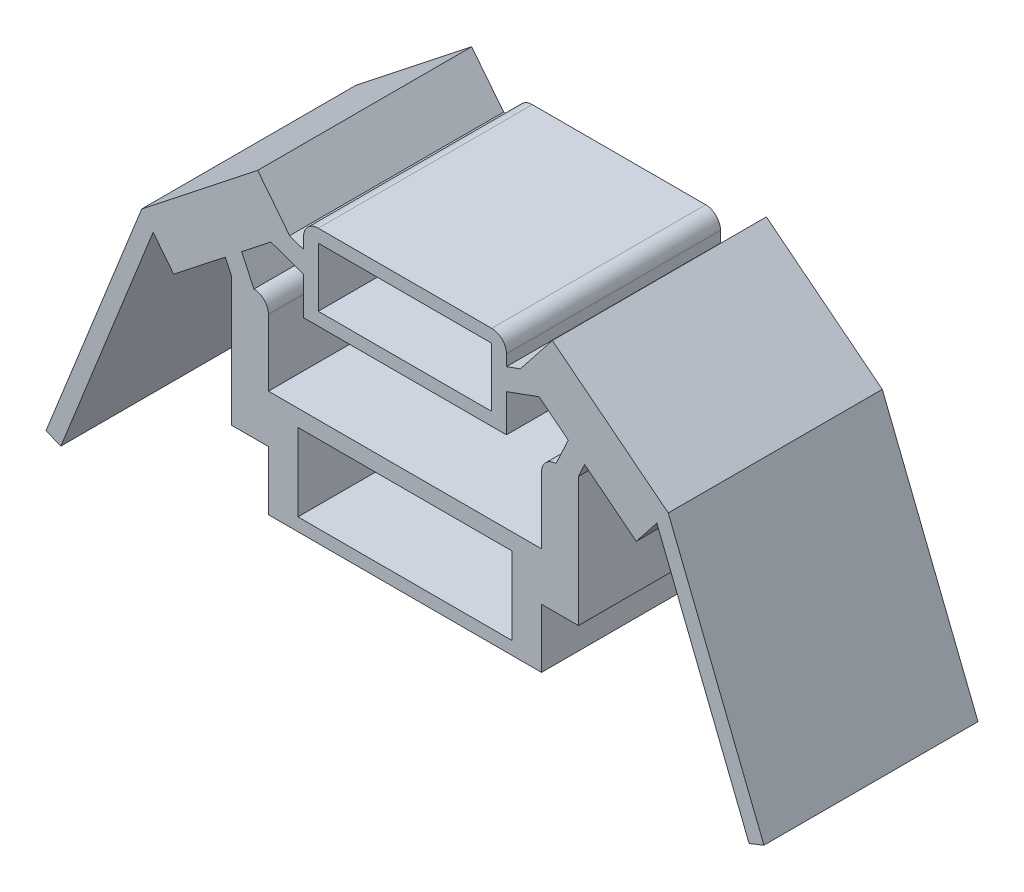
ISO-10303-21;
HEADER;
FILE_DESCRIPTION(('STEP AP214'),'2;1');
FILE_NAME('part.step','',(''),(''),'','','');
FILE_SCHEMA(('AUTOMOTIVE_DESIGN { 1 0 10303 214 1 1 1 1 }'));
ENDSEC;
DATA;
#1=APPLICATION_CONTEXT('core data for automotive mechanical design processes');
#2=APPLICATION_PROTOCOL_DEFINITION('international standard','automotive_design',2000,#1);
#3=PRODUCT_CONTEXT('',#1,'mechanical');
#4=PRODUCT('Part','Part','',(#3));
#5=PRODUCT_RELATED_PRODUCT_CATEGORY('part','',(#4));
#6=PRODUCT_DEFINITION_FORMATION('','',#4);
#7=PRODUCT_DEFINITION_CONTEXT('part definition',#1,'design');
#8=PRODUCT_DEFINITION('design','',#6,#7);
#9=PRODUCT_DEFINITION_SHAPE('','',#8);
#10=(LENGTH_UNIT() NAMED_UNIT(*) SI_UNIT(.MILLI.,.METRE.));
#11=(NAMED_UNIT(*) PLANE_ANGLE_UNIT() SI_UNIT($,.RADIAN.));
#12=(NAMED_UNIT(*) SI_UNIT($,.STERADIAN.) SOLID_ANGLE_UNIT());
#13=UNCERTAINTY_MEASURE_WITH_UNIT(LENGTH_MEASURE(1.E-05),#10,'distance_accuracy_value','');
#14=(GEOMETRIC_REPRESENTATION_CONTEXT(3) GLOBAL_UNCERTAINTY_ASSIGNED_CONTEXT((#13)) GLOBAL_UNIT_ASSIGNED_CONTEXT((#10,
#11,#12)) REPRESENTATION_CONTEXT('',''));
#15=CARTESIAN_POINT('',(0.,0.,0.));
#16=DIRECTION('',(0.,0.,1.));
#17=DIRECTION('',(1.,0.,0.));
#18=AXIS2_PLACEMENT_3D('',#15,#16,#17);
#19=CARTESIAN_POINT('',(3.7,1.4,5.8));
#20=DIRECTION('',(1.,0.,0.));
#21=DIRECTION('',(0.,0.,-1.));
#22=AXIS2_PLACEMENT_3D('',#19,#20,#21);
#23=PLANE('',#22);
#24=DIRECTION('',(0.,-1.,0.));
#25=VECTOR('',#24,1.);
#26=CARTESIAN_POINT('',(3.7,1.4,5.8));
#27=LINE('',#26,#25);
#28=CARTESIAN_POINT('',(3.7,3.20005879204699,5.8));
#29=VERTEX_POINT('',#28);
#30=CARTESIAN_POINT('',(3.7,1.4,5.8));
#31=VERTEX_POINT('',#30);
#32=EDGE_CURVE('E612',#29,#31,#27,.T.);
#33=ORIENTED_EDGE('',*,*,#32,.F.);
#34=DIRECTION('',(0.,0.,1.));
#35=VECTOR('',#34,1.);
#36=CARTESIAN_POINT('',(3.7,3.20005879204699,5.8));
#37=LINE('',#36,#35);
#38=CARTESIAN_POINT('',(3.7,3.20005879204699,0.));
#39=VERTEX_POINT('',#38);
#40=EDGE_CURVE('E761',#29,#39,#37,.F.);
#41=ORIENTED_EDGE('',*,*,#40,.T.);
#42=DIRECTION('',(0.,-1.,0.));
#43=VECTOR('',#42,1.);
#44=CARTESIAN_POINT('',(3.7,1.4,0.));
#45=LINE('',#44,#43);
#46=CARTESIAN_POINT('',(3.7,1.4,0.));
#47=VERTEX_POINT('',#46);
#48=EDGE_CURVE('E611',#39,#47,#45,.T.);
#49=ORIENTED_EDGE('',*,*,#48,.T.);
#50=DIRECTION('',(0.,0.,-1.));
#51=VECTOR('',#50,1.);
#52=CARTESIAN_POINT('',(3.7,1.4,5.8));
#53=LINE('',#52,#51);
#54=EDGE_CURVE('E738',#31,#47,#53,.T.);
#55=ORIENTED_EDGE('',*,*,#54,.F.);
#56=EDGE_LOOP('',(#33,#41,#49,#55));
#57=FACE_BOUND('',#56,.T.);
#58=ADVANCED_FACE('F38',(#57),#23,.F.);
#59=CARTESIAN_POINT('',(-3.7,1.4,5.8));
#60=DIRECTION('',(0.,-1.,0.));
#61=DIRECTION('',(0.,0.,-1.));
#62=AXIS2_PLACEMENT_3D('',#59,#60,#61);
#63=PLANE('',#62);
#64=DIRECTION('',(-1.,0.,0.));
#65=VECTOR('',#64,1.);
#66=CARTESIAN_POINT('',(-3.7,1.4,0.));
#67=LINE('',#66,#65);
#68=CARTESIAN_POINT('',(-3.7,1.4,0.));
#69=VERTEX_POINT('',#68);
#70=EDGE_CURVE('E653',#47,#69,#67,.T.);
#71=ORIENTED_EDGE('',*,*,#70,.T.);
#72=DIRECTION('',(0.,0.,-1.));
#73=VECTOR('',#72,1.);
#74=CARTESIAN_POINT('',(-3.7,1.4,5.8));
#75=LINE('',#74,#73);
#76=CARTESIAN_POINT('',(-3.7,1.4,5.8));
#77=VERTEX_POINT('',#76);
#78=EDGE_CURVE('E735',#77,#69,#75,.T.);
#79=ORIENTED_EDGE('',*,*,#78,.F.);
#80=DIRECTION('',(-1.,0.,0.));
#81=VECTOR('',#80,1.);
#82=CARTESIAN_POINT('',(-3.7,1.4,5.8));
#83=LINE('',#82,#81);
#84=EDGE_CURVE('E614',#31,#77,#83,.T.);
#85=ORIENTED_EDGE('',*,*,#84,.F.);
#86=ORIENTED_EDGE('',*,*,#54,.T.);
#87=EDGE_LOOP('',(#71,#79,#85,#86));
#88=FACE_BOUND('',#87,.T.);
#89=ADVANCED_FACE('F827',(#88),#63,.F.);
#90=CARTESIAN_POINT('',(-3.7,-1.4,5.8));
#91=DIRECTION('',(1.,0.,0.));
#92=DIRECTION('',(0.,0.,-1.));
#93=AXIS2_PLACEMENT_3D('',#90,#91,#92);
#94=PLANE('',#93);
#95=DIRECTION('',(0.,-1.,0.));
#96=VECTOR('',#95,1.);
#97=CARTESIAN_POINT('',(-3.7,-1.4,5.8));
#98=LINE('',#97,#96);
#99=CARTESIAN_POINT('',(-3.7,0.0999999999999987,5.8));
#100=VERTEX_POINT('',#99);
#101=CARTESIAN_POINT('',(-3.7,-1.5,5.8));
#102=VERTEX_POINT('',#101);
#103=EDGE_CURVE('E618',#100,#102,#98,.T.);
#104=ORIENTED_EDGE('',*,*,#103,.F.);
#105=DIRECTION('',(0.,0.,-1.));
#106=VECTOR('',#105,1.);
#107=CARTESIAN_POINT('',(-3.7,0.0999999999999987,5.8));
#108=LINE('',#107,#106);
#109=CARTESIAN_POINT('',(-3.7,0.0999999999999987,0.));
#110=VERTEX_POINT('',#109);
#111=EDGE_CURVE('E551',#100,#110,#108,.T.);
#112=ORIENTED_EDGE('',*,*,#111,.T.);
#113=DIRECTION('',(0.,-1.,0.));
#114=VECTOR('',#113,1.);
#115=CARTESIAN_POINT('',(-3.7,-1.4,0.));
#116=LINE('',#115,#114);
#117=CARTESIAN_POINT('',(-3.7,-1.5,0.));
#118=VERTEX_POINT('',#117);
#119=EDGE_CURVE('E656',#110,#118,#116,.T.);
#120=ORIENTED_EDGE('',*,*,#119,.T.);
#121=DIRECTION('',(0.,0.,1.));
#122=VECTOR('',#121,1.);
#123=CARTESIAN_POINT('',(-3.7,-1.5,-7.40067564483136));
#124=LINE('',#123,#122);
#125=EDGE_CURVE('E406',#118,#102,#124,.T.);
#126=ORIENTED_EDGE('',*,*,#125,.T.);
#127=EDGE_LOOP('',(#104,#112,#120,#126));
#128=FACE_BOUND('',#127,.T.);
#129=ADVANCED_FACE('F829',(#128),#94,.F.);
#130=CARTESIAN_POINT('',(3.7,-1.4,5.8));
#131=DIRECTION('',(-1.,0.,0.));
#132=DIRECTION('',(0.,0.,1.));
#133=AXIS2_PLACEMENT_3D('',#130,#131,#132);
#134=PLANE('',#133);
#135=DIRECTION('',(0.,1.,0.));
#136=VECTOR('',#135,1.);
#137=CARTESIAN_POINT('',(3.7,-1.4,0.));
#138=LINE('',#137,#136);
#139=CARTESIAN_POINT('',(3.7,-1.5,0.));
#140=VERTEX_POINT('',#139);
#141=CARTESIAN_POINT('',(3.7,0.0999999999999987,0.));
#142=VERTEX_POINT('',#141);
#143=EDGE_CURVE('E658',#140,#142,#138,.T.);
#144=ORIENTED_EDGE('',*,*,#143,.T.);
#145=DIRECTION('',(0.,0.,-1.));
#146=VECTOR('',#145,1.);
#147=CARTESIAN_POINT('',(3.7,0.0999999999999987,5.8));
#148=LINE('',#147,#146);
#149=CARTESIAN_POINT('',(3.7,0.0999999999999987,5.8));
#150=VERTEX_POINT('',#149);
#151=EDGE_CURVE('E732',#150,#142,#148,.T.);
#152=ORIENTED_EDGE('',*,*,#151,.F.);
#153=DIRECTION('',(0.,1.,0.));
#154=VECTOR('',#153,1.);
#155=CARTESIAN_POINT('',(3.7,-1.4,5.8));
#156=LINE('',#155,#154);
#157=CARTESIAN_POINT('',(3.7,-1.5,5.8));
#158=VERTEX_POINT('',#157);
#159=EDGE_CURVE('E620',#158,#150,#156,.T.);
#160=ORIENTED_EDGE('',*,*,#159,.F.);
#161=DIRECTION('',(0.,0.,1.));
#162=VECTOR('',#161,1.);
#163=CARTESIAN_POINT('',(3.7,-1.5,-7.40067564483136));
#164=LINE('',#163,#162);
#165=EDGE_CURVE('E403',#140,#158,#164,.T.);
#166=ORIENTED_EDGE('',*,*,#165,.F.);
#167=EDGE_LOOP('',(#144,#152,#160,#166));
#168=FACE_BOUND('',#167,.T.);
#169=ADVANCED_FACE('F835',(#168),#134,.F.);
#170=CARTESIAN_POINT('',(3.7,0.0999999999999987,5.8));
#171=DIRECTION('',(0.,1.,0.));
#172=DIRECTION('',(0.,0.,1.));
#173=AXIS2_PLACEMENT_3D('',#170,#171,#172);
#174=PLANE('',#173);
#175=DIRECTION('',(1.,0.,0.));
#176=VECTOR('',#175,1.);
#177=CARTESIAN_POINT('',(3.7,0.0999999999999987,0.));
#178=LINE('',#177,#176);
#179=CARTESIAN_POINT('',(4.7,0.0999999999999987,0.));
#180=VERTEX_POINT('',#179);
#181=EDGE_CURVE('E660',#142,#180,#178,.T.);
#182=ORIENTED_EDGE('',*,*,#181,.T.);
#183=DIRECTION('',(0.,0.,-1.));
#184=VECTOR('',#183,1.);
#185=CARTESIAN_POINT('',(4.7,0.0999999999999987,5.8));
#186=LINE('',#185,#184);
#187=CARTESIAN_POINT('',(4.7,0.0999999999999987,5.8));
#188=VERTEX_POINT('',#187);
#189=EDGE_CURVE('E729',#188,#180,#186,.T.);
#190=ORIENTED_EDGE('',*,*,#189,.F.);
#191=DIRECTION('',(1.,0.,0.));
#192=VECTOR('',#191,1.);
#193=CARTESIAN_POINT('',(3.7,0.0999999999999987,5.8));
#194=LINE('',#193,#192);
#195=EDGE_CURVE('E622',#150,#188,#194,.T.);
#196=ORIENTED_EDGE('',*,*,#195,.F.);
#197=ORIENTED_EDGE('',*,*,#151,.T.);
#198=EDGE_LOOP('',(#182,#190,#196,#197));
#199=FACE_BOUND('',#198,.T.);
#200=ADVANCED_FACE('F1007',(#199),#174,.F.);
#201=CARTESIAN_POINT('',(4.7,3.6,5.8));
#202=DIRECTION('',(-1.,0.,0.));
#203=DIRECTION('',(0.,-1.,0.));
#204=AXIS2_PLACEMENT_3D('',#201,#202,#203);
#205=PLANE('',#204);
#206=DIRECTION('',(0.,1.,0.));
#207=VECTOR('',#206,1.);
#208=CARTESIAN_POINT('',(4.7,3.6,0.));
#209=LINE('',#208,#207);
#210=CARTESIAN_POINT('',(4.7,3.6,0.));
#211=VERTEX_POINT('',#210);
#212=EDGE_CURVE('E662',#180,#211,#209,.T.);
#213=ORIENTED_EDGE('',*,*,#212,.T.);
#214=DIRECTION('',(0.,0.,-1.));
#215=VECTOR('',#214,1.);
#216=CARTESIAN_POINT('',(4.7,3.6,5.8));
#217=LINE('',#216,#215);
#218=CARTESIAN_POINT('',(4.7,3.6,5.8));
#219=VERTEX_POINT('',#218);
#220=EDGE_CURVE('E726',#219,#211,#217,.T.);
#221=ORIENTED_EDGE('',*,*,#220,.F.);
#222=DIRECTION('',(0.,1.,0.));
#223=VECTOR('',#222,1.);
#224=CARTESIAN_POINT('',(4.7,3.6,5.8));
#225=LINE('',#224,#223);
#226=EDGE_CURVE('E624',#188,#219,#225,.T.);
#227=ORIENTED_EDGE('',*,*,#226,.F.);
#228=ORIENTED_EDGE('',*,*,#189,.T.);
#229=EDGE_LOOP('',(#213,#221,#227,#228));
#230=FACE_BOUND('',#229,.T.);
#231=ADVANCED_FACE('F1003',(#230),#205,.F.);
#232=CARTESIAN_POINT('',(4.7,3.6,5.8));
#233=DIRECTION('',(-0.906307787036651,0.422618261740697,0.));
#234=DIRECTION('',(-0.422618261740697,-0.906307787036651,0.));
#235=AXIS2_PLACEMENT_3D('',#232,#233,#234);
#236=PLANE('',#235);
#237=DIRECTION('',(0.422618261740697,0.906307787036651,0.));
#238=VECTOR('',#237,1.);
#239=CARTESIAN_POINT('',(4.7,3.6,0.));
#240=LINE('',#239,#238);
#241=CARTESIAN_POINT('',(4.86904730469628,3.96252311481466,0.));
#242=VERTEX_POINT('',#241);
#243=EDGE_CURVE('E664',#211,#242,#240,.T.);
#244=ORIENTED_EDGE('',*,*,#243,.T.);
#245=DIRECTION('',(0.,0.,-1.));
#246=VECTOR('',#245,1.);
#247=CARTESIAN_POINT('',(4.86904730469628,3.96252311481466,5.8));
#248=LINE('',#247,#246);
#249=CARTESIAN_POINT('',(4.86904730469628,3.96252311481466,5.8));
#250=VERTEX_POINT('',#249);
#251=EDGE_CURVE('E723',#250,#242,#248,.T.);
#252=ORIENTED_EDGE('',*,*,#251,.F.);
#253=DIRECTION('',(0.422618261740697,0.906307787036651,0.));
#254=VECTOR('',#253,1.);
#255=CARTESIAN_POINT('',(4.7,3.6,5.8));
#256=LINE('',#255,#254);
#257=EDGE_CURVE('E626',#219,#250,#256,.T.);
#258=ORIENTED_EDGE('',*,*,#257,.F.);
#259=ORIENTED_EDGE('',*,*,#220,.T.);
#260=EDGE_LOOP('',(#244,#252,#258,#259));
#261=FACE_BOUND('',#260,.T.);
#262=ADVANCED_FACE('F999',(#261),#236,.F.);
#263=CARTESIAN_POINT('',(4.86904730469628,3.96252311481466,5.8));
#264=DIRECTION('',(0.619116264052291,0.78529933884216,0.));
#265=DIRECTION('',(-0.78529933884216,0.619116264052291,0.));
#266=AXIS2_PLACEMENT_3D('',#263,#264,#265);
#267=PLANE('',#266);
#268=DIRECTION('',(0.78529933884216,-0.619116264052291,0.));
#269=VECTOR('',#268,1.);
#270=CARTESIAN_POINT('',(4.86904730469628,3.96252311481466,0.));
#271=LINE('',#270,#269);
#272=CARTESIAN_POINT('',(6.267074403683,2.86034300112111,0.));
#273=VERTEX_POINT('',#272);
#274=EDGE_CURVE('E666',#242,#273,#271,.T.);
#275=ORIENTED_EDGE('',*,*,#274,.T.);
#276=DIRECTION('',(0.,0.,-1.));
#277=VECTOR('',#276,1.);
#278=CARTESIAN_POINT('',(6.267074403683,2.86034300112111,5.8));
#279=LINE('',#278,#277);
#280=CARTESIAN_POINT('',(6.267074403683,2.86034300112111,5.8));
#281=VERTEX_POINT('',#280);
#282=EDGE_CURVE('E720',#281,#273,#279,.T.);
#283=ORIENTED_EDGE('',*,*,#282,.F.);
#284=DIRECTION('',(0.78529933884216,-0.619116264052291,0.));
#285=VECTOR('',#284,1.);
#286=CARTESIAN_POINT('',(4.86904730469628,3.96252311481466,5.8));
#287=LINE('',#286,#285);
#288=EDGE_CURVE('E628',#250,#281,#287,.T.);
#289=ORIENTED_EDGE('',*,*,#288,.F.);
#290=ORIENTED_EDGE('',*,*,#251,.T.);
#291=EDGE_LOOP('',(#275,#283,#289,#290));
#292=FACE_BOUND('',#291,.T.);
#293=ADVANCED_FACE('F995',(#292),#267,.F.);
#294=CARTESIAN_POINT('',(6.267074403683,2.86034300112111,5.8));
#295=DIRECTION('',(-0.78529933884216,0.619116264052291,0.));
#296=DIRECTION('',(-0.619116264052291,-0.78529933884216,0.));
#297=AXIS2_PLACEMENT_3D('',#294,#295,#296);
#298=PLANE('',#297);
#299=DIRECTION('',(0.619116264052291,0.78529933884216,0.));
#300=VECTOR('',#299,1.);
#301=CARTESIAN_POINT('',(6.267074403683,2.86034300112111,0.));
#302=LINE('',#301,#300);
#303=CARTESIAN_POINT('',(6.82427904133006,3.56711240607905,0.));
#304=VERTEX_POINT('',#303);
#305=EDGE_CURVE('E668',#273,#304,#302,.T.);
#306=ORIENTED_EDGE('',*,*,#305,.T.);
#307=DIRECTION('',(0.,0.,1.));
#308=VECTOR('',#307,1.);
#309=CARTESIAN_POINT('',(6.82427904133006,3.56711240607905,-7.26730488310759));
#310=LINE('',#309,#308);
#311=CARTESIAN_POINT('',(6.82427904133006,3.56711240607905,5.8));
#312=VERTEX_POINT('',#311);
#313=EDGE_CURVE('E435',#304,#312,#310,.T.);
#314=ORIENTED_EDGE('',*,*,#313,.T.);
#315=DIRECTION('',(0.619116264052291,0.78529933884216,0.));
#316=VECTOR('',#315,1.);
#317=CARTESIAN_POINT('',(6.267074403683,2.86034300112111,5.8));
#318=LINE('',#317,#316);
#319=EDGE_CURVE('E630',#281,#312,#318,.T.);
#320=ORIENTED_EDGE('',*,*,#319,.F.);
#321=ORIENTED_EDGE('',*,*,#282,.T.);
#322=EDGE_LOOP('',(#306,#314,#320,#321));
#323=FACE_BOUND('',#322,.T.);
#324=ADVANCED_FACE('F991',(#323),#298,.F.);
#325=CARTESIAN_POINT('',(3.99263981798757,6.43622713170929,5.8));
#326=DIRECTION('',(-0.619116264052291,-0.78529933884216,0.));
#327=DIRECTION('',(0.78529933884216,-0.619116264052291,0.));
#328=AXIS2_PLACEMENT_3D('',#325,#326,#327);
#329=PLANE('',#328);
#330=DIRECTION('',(-0.78529933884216,0.619116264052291,0.));
#331=VECTOR('',#330,1.);
#332=CARTESIAN_POINT('',(3.99263981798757,6.43622713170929,0.));
#333=LINE('',#332,#331);
#334=CARTESIAN_POINT('',(7.13383717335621,3.95976207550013,0.));
#335=VERTEX_POINT('',#334);
#336=CARTESIAN_POINT('',(3.99263981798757,6.43622713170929,0.));
#337=VERTEX_POINT('',#336);
#338=EDGE_CURVE('E670',#335,#337,#333,.T.);
#339=ORIENTED_EDGE('',*,*,#338,.T.);
#340=DIRECTION('',(0.,0.,-1.));
#341=VECTOR('',#340,1.);
#342=CARTESIAN_POINT('',(3.99263981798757,6.43622713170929,5.8));
#343=LINE('',#342,#341);
#344=CARTESIAN_POINT('',(3.99263981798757,6.43622713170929,5.8));
#345=VERTEX_POINT('',#344);
#346=EDGE_CURVE('E714',#345,#337,#343,.T.);
#347=ORIENTED_EDGE('',*,*,#346,.F.);
#348=DIRECTION('',(-0.78529933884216,0.619116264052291,0.));
#349=VECTOR('',#348,1.);
#350=CARTESIAN_POINT('',(3.99263981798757,6.43622713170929,5.8));
#351=LINE('',#350,#349);
#352=CARTESIAN_POINT('',(7.13383717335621,3.95976207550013,5.8));
#353=VERTEX_POINT('',#352);
#354=EDGE_CURVE('E633',#353,#345,#351,.T.);
#355=ORIENTED_EDGE('',*,*,#354,.F.);
#356=DIRECTION('',(0.,0.,-1.));
#357=VECTOR('',#356,1.);
#358=CARTESIAN_POINT('',(7.13383717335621,3.95976207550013,5.8));
#359=LINE('',#358,#357);
#360=EDGE_CURVE('E717',#353,#335,#359,.T.);
#361=ORIENTED_EDGE('',*,*,#360,.T.);
#362=EDGE_LOOP('',(#339,#347,#355,#361));
#363=FACE_BOUND('',#362,.T.);
#364=ADVANCED_FACE('F987',(#363),#329,.F.);
#365=CARTESIAN_POINT('',(3.99263981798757,6.43622713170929,5.8));
#366=DIRECTION('',(0.78529933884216,-0.619116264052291,0.));
#367=DIRECTION('',(0.619116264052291,0.78529933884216,0.));
#368=AXIS2_PLACEMENT_3D('',#365,#366,#367);
#369=PLANE('',#368);
#370=DIRECTION('',(-0.619116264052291,-0.78529933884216,0.));
#371=VECTOR('',#370,1.);
#372=CARTESIAN_POINT('',(3.99263981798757,6.43622713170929,0.));
#373=LINE('',#372,#371);
#374=CARTESIAN_POINT('',(3.12587704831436,5.33680805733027,0.));
#375=VERTEX_POINT('',#374);
#376=EDGE_CURVE('E672',#337,#375,#373,.T.);
#377=ORIENTED_EDGE('',*,*,#376,.T.);
#378=DIRECTION('',(0.,0.,-1.));
#379=VECTOR('',#378,1.);
#380=CARTESIAN_POINT('',(3.12587704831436,5.33680805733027,5.8));
#381=LINE('',#380,#379);
#382=CARTESIAN_POINT('',(3.12587704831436,5.33680805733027,5.8));
#383=VERTEX_POINT('',#382);
#384=EDGE_CURVE('E711',#383,#375,#381,.T.);
#385=ORIENTED_EDGE('',*,*,#384,.F.);
#386=DIRECTION('',(-0.619116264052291,-0.78529933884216,0.));
#387=VECTOR('',#386,1.);
#388=CARTESIAN_POINT('',(3.99263981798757,6.43622713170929,5.8));
#389=LINE('',#388,#387);
#390=EDGE_CURVE('E635',#345,#383,#389,.T.);
#391=ORIENTED_EDGE('',*,*,#390,.F.);
#392=ORIENTED_EDGE('',*,*,#346,.T.);
#393=EDGE_LOOP('',(#377,#385,#391,#392));
#394=FACE_BOUND('',#393,.T.);
#395=ADVANCED_FACE('F983',(#394),#369,.F.);
#396=CARTESIAN_POINT('',(2.75,5.2,5.8));
#397=DIRECTION('',(0.342020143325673,-0.939692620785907,0.));
#398=DIRECTION('',(0.939692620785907,0.342020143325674,0.));
#399=AXIS2_PLACEMENT_3D('',#396,#397,#398);
#400=PLANE('',#399);
#401=DIRECTION('',(-0.939692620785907,-0.342020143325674,0.));
#402=VECTOR('',#401,1.);
#403=CARTESIAN_POINT('',(2.75,5.2,0.));
#404=LINE('',#403,#402);
#405=CARTESIAN_POINT('',(2.75,5.2,0.));
#406=VERTEX_POINT('',#405);
#407=EDGE_CURVE('E674',#375,#406,#404,.T.);
#408=ORIENTED_EDGE('',*,*,#407,.T.);
#409=DIRECTION('',(0.,0.,-1.));
#410=VECTOR('',#409,1.);
#411=CARTESIAN_POINT('',(2.75,5.2,5.8));
#412=LINE('',#411,#410);
#413=CARTESIAN_POINT('',(2.75,5.2,5.8));
#414=VERTEX_POINT('',#413);
#415=EDGE_CURVE('E708',#414,#406,#412,.T.);
#416=ORIENTED_EDGE('',*,*,#415,.F.);
#417=DIRECTION('',(-0.939692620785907,-0.342020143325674,0.));
#418=VECTOR('',#417,1.);
#419=CARTESIAN_POINT('',(2.75,5.2,5.8));
#420=LINE('',#419,#418);
#421=EDGE_CURVE('E637',#383,#414,#420,.T.);
#422=ORIENTED_EDGE('',*,*,#421,.F.);
#423=ORIENTED_EDGE('',*,*,#384,.T.);
#424=EDGE_LOOP('',(#408,#416,#422,#423));
#425=FACE_BOUND('',#424,.T.);
#426=ADVANCED_FACE('F980',(#425),#400,.F.);
#427=CARTESIAN_POINT('',(-2.75,5.2,5.8));
#428=DIRECTION('',(1.,0.,0.));
#429=DIRECTION('',(0.,0.,-1.));
#430=AXIS2_PLACEMENT_3D('',#427,#428,#429);
#431=PLANE('',#430);
#432=DIRECTION('',(0.,-1.,0.));
#433=VECTOR('',#432,1.);
#434=CARTESIAN_POINT('',(-2.75,5.2,5.8));
#435=LINE('',#434,#433);
#436=CARTESIAN_POINT('',(-2.75,4.61470222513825,5.8));
#437=VERTEX_POINT('',#436);
#438=CARTESIAN_POINT('',(-2.75,3.6,5.8));
#439=VERTEX_POINT('',#438);
#440=EDGE_CURVE('E639',#437,#439,#435,.T.);
#441=ORIENTED_EDGE('',*,*,#440,.F.);
#442=DIRECTION('',(0.,0.,-1.));
#443=VECTOR('',#442,1.);
#444=CARTESIAN_POINT('',(-2.75,4.61470222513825,5.8));
#445=LINE('',#444,#443);
#446=CARTESIAN_POINT('',(-2.75,4.61470222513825,0.));
#447=VERTEX_POINT('',#446);
#448=EDGE_CURVE('E601',#437,#447,#445,.T.);
#449=ORIENTED_EDGE('',*,*,#448,.T.);
#450=DIRECTION('',(0.,-1.,0.));
#451=VECTOR('',#450,1.);
#452=CARTESIAN_POINT('',(-2.75,5.2,0.));
#453=LINE('',#452,#451);
#454=CARTESIAN_POINT('',(-2.75,3.6,0.));
#455=VERTEX_POINT('',#454);
#456=EDGE_CURVE('E676',#447,#455,#453,.T.);
#457=ORIENTED_EDGE('',*,*,#456,.T.);
#458=DIRECTION('',(0.,0.,-1.));
#459=VECTOR('',#458,1.);
#460=CARTESIAN_POINT('',(-2.75,3.6,5.8));
#461=LINE('',#460,#459);
#462=EDGE_CURVE('E702',#439,#455,#461,.T.);
#463=ORIENTED_EDGE('',*,*,#462,.F.);
#464=EDGE_LOOP('',(#441,#449,#457,#463));
#465=FACE_BOUND('',#464,.T.);
#466=ADVANCED_FACE('F809',(#465),#431,.F.);
#467=CARTESIAN_POINT('',(-2.75,3.6,5.8));
#468=DIRECTION('',(0.,1.,0.));
#469=DIRECTION('',(0.,0.,1.));
#470=AXIS2_PLACEMENT_3D('',#467,#468,#469);
#471=PLANE('',#470);
#472=DIRECTION('',(1.,0.,0.));
#473=VECTOR('',#472,1.);
#474=CARTESIAN_POINT('',(-2.75,3.6,0.));
#475=LINE('',#474,#473);
#476=CARTESIAN_POINT('',(2.75,3.6,0.));
#477=VERTEX_POINT('',#476);
#478=EDGE_CURVE('E678',#455,#477,#475,.T.);
#479=ORIENTED_EDGE('',*,*,#478,.T.);
#480=DIRECTION('',(0.,0.,-1.));
#481=VECTOR('',#480,1.);
#482=CARTESIAN_POINT('',(2.75,3.6,5.8));
#483=LINE('',#482,#481);
#484=CARTESIAN_POINT('',(2.75,3.6,5.8));
#485=VERTEX_POINT('',#484);
#486=EDGE_CURVE('E699',#485,#477,#483,.T.);
#487=ORIENTED_EDGE('',*,*,#486,.F.);
#488=DIRECTION('',(1.,0.,0.));
#489=VECTOR('',#488,1.);
#490=CARTESIAN_POINT('',(-2.75,3.6,5.8));
#491=LINE('',#490,#489);
#492=EDGE_CURVE('E641',#439,#485,#491,.T.);
#493=ORIENTED_EDGE('',*,*,#492,.F.);
#494=ORIENTED_EDGE('',*,*,#462,.T.);
#495=EDGE_LOOP('',(#479,#487,#493,#494));
#496=FACE_BOUND('',#495,.T.);
#497=ADVANCED_FACE('F804',(#496),#471,.F.);
#498=CARTESIAN_POINT('',(2.75,4.61470222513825,5.8));
#499=DIRECTION('',(-1.,0.,0.));
#500=DIRECTION('',(0.,-1.,0.));
#501=AXIS2_PLACEMENT_3D('',#498,#499,#500);
#502=PLANE('',#501);
#503=DIRECTION('',(0.,1.,0.));
#504=VECTOR('',#503,1.);
#505=CARTESIAN_POINT('',(2.75,4.61470222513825,0.));
#506=LINE('',#505,#504);
#507=CARTESIAN_POINT('',(2.75,4.61470222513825,0.));
#508=VERTEX_POINT('',#507);
#509=EDGE_CURVE('E680',#477,#508,#506,.T.);
#510=ORIENTED_EDGE('',*,*,#509,.T.);
#511=DIRECTION('',(0.,0.,-1.));
#512=VECTOR('',#511,1.);
#513=CARTESIAN_POINT('',(2.75,4.61470222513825,5.8));
#514=LINE('',#513,#512);
#515=CARTESIAN_POINT('',(2.75,4.61470222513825,5.8));
#516=VERTEX_POINT('',#515);
#517=EDGE_CURVE('E696',#516,#508,#514,.T.);
#518=ORIENTED_EDGE('',*,*,#517,.F.);
#519=DIRECTION('',(0.,1.,0.));
#520=VECTOR('',#519,1.);
#521=CARTESIAN_POINT('',(2.75,4.61470222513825,5.8));
#522=LINE('',#521,#520);
#523=EDGE_CURVE('E643',#485,#516,#522,.T.);
#524=ORIENTED_EDGE('',*,*,#523,.F.);
#525=ORIENTED_EDGE('',*,*,#486,.T.);
#526=EDGE_LOOP('',(#510,#518,#524,#525));
#527=FACE_BOUND('',#526,.T.);
#528=ADVANCED_FACE('F800',(#527),#502,.F.);
#529=CARTESIAN_POINT('',(2.75,4.61470222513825,5.8));
#530=DIRECTION('',(-0.342020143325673,0.939692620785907,0.));
#531=DIRECTION('',(-0.939692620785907,-0.342020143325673,0.));
#532=AXIS2_PLACEMENT_3D('',#529,#530,#531);
#533=PLANE('',#532);
#534=DIRECTION('',(0.939692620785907,0.342020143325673,0.));
#535=VECTOR('',#534,1.);
#536=CARTESIAN_POINT('',(2.75,4.61470222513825,0.));
#537=LINE('',#536,#535);
#538=CARTESIAN_POINT('',(3.63379250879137,4.93637639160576,0.));
#539=VERTEX_POINT('',#538);
#540=EDGE_CURVE('E682',#508,#539,#537,.T.);
#541=ORIENTED_EDGE('',*,*,#540,.T.);
#542=DIRECTION('',(0.,0.,-1.));
#543=VECTOR('',#542,1.);
#544=CARTESIAN_POINT('',(3.63379250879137,4.93637639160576,5.8));
#545=LINE('',#544,#543);
#546=CARTESIAN_POINT('',(3.63379250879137,4.93637639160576,5.8));
#547=VERTEX_POINT('',#546);
#548=EDGE_CURVE('E693',#547,#539,#545,.T.);
#549=ORIENTED_EDGE('',*,*,#548,.F.);
#550=DIRECTION('',(0.939692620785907,0.342020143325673,0.));
#551=VECTOR('',#550,1.);
#552=CARTESIAN_POINT('',(2.75,4.61470222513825,5.8));
#553=LINE('',#552,#551);
#554=EDGE_CURVE('E645',#516,#547,#553,.T.);
#555=ORIENTED_EDGE('',*,*,#554,.F.);
#556=ORIENTED_EDGE('',*,*,#517,.T.);
#557=EDGE_LOOP('',(#541,#549,#555,#556));
#558=FACE_BOUND('',#557,.T.);
#559=ADVANCED_FACE('F795',(#558),#533,.F.);
#560=CARTESIAN_POINT('',(3.63379250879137,4.93637639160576,5.8));
#561=DIRECTION('',(0.619116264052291,0.78529933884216,0.));
#562=DIRECTION('',(-0.78529933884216,0.619116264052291,0.));
#563=AXIS2_PLACEMENT_3D('',#560,#561,#562);
#564=PLANE('',#563);
#565=DIRECTION('',(0.78529933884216,-0.619116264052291,0.));
#566=VECTOR('',#565,1.);
#567=CARTESIAN_POINT('',(3.63379250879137,4.93637639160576,0.));
#568=LINE('',#567,#566);
#569=CARTESIAN_POINT('',(4.42531735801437,4.31235204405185,0.));
#570=VERTEX_POINT('',#569);
#571=EDGE_CURVE('E684',#539,#570,#568,.T.);
#572=ORIENTED_EDGE('',*,*,#571,.T.);
#573=DIRECTION('',(0.,0.,-1.));
#574=VECTOR('',#573,1.);
#575=CARTESIAN_POINT('',(4.42531735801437,4.31235204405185,5.8));
#576=LINE('',#575,#574);
#577=CARTESIAN_POINT('',(4.42531735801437,4.31235204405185,5.8));
#578=VERTEX_POINT('',#577);
#579=EDGE_CURVE('E690',#578,#570,#576,.T.);
#580=ORIENTED_EDGE('',*,*,#579,.F.);
#581=DIRECTION('',(0.78529933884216,-0.619116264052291,0.));
#582=VECTOR('',#581,1.);
#583=CARTESIAN_POINT('',(3.63379250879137,4.93637639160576,5.8));
#584=LINE('',#583,#582);
#585=EDGE_CURVE('E647',#547,#578,#584,.T.);
#586=ORIENTED_EDGE('',*,*,#585,.F.);
#587=ORIENTED_EDGE('',*,*,#548,.T.);
#588=EDGE_LOOP('',(#572,#580,#586,#587));
#589=FACE_BOUND('',#588,.T.);
#590=ADVANCED_FACE('F789',(#589),#564,.F.);
#591=CARTESIAN_POINT('',(4.09314214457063,3.6,5.8));
#592=DIRECTION('',(0.906307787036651,-0.422618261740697,0.));
#593=DIRECTION('',(0.422618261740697,0.906307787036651,0.));
#594=AXIS2_PLACEMENT_3D('',#591,#592,#593);
#595=PLANE('',#594);
#596=DIRECTION('',(-0.422618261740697,-0.906307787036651,0.));
#597=VECTOR('',#596,1.);
#598=CARTESIAN_POINT('',(4.09314214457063,3.6,0.));
#599=LINE('',#598,#597);
#600=CARTESIAN_POINT('',(4.09314214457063,3.6,0.));
#601=VERTEX_POINT('',#600);
#602=EDGE_CURVE('E615',#570,#601,#599,.T.);
#603=ORIENTED_EDGE('',*,*,#602,.T.);
#604=DIRECTION('',(0.,0.,-1.));
#605=VECTOR('',#604,1.);
#606=CARTESIAN_POINT('',(4.09314214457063,3.6,5.8));
#607=LINE('',#606,#605);
#608=CARTESIAN_POINT('',(4.09314214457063,3.6,5.8));
#609=VERTEX_POINT('',#608);
#610=EDGE_CURVE('E651',#609,#601,#607,.T.);
#611=ORIENTED_EDGE('',*,*,#610,.F.);
#612=DIRECTION('',(-0.422618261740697,-0.906307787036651,0.));
#613=VECTOR('',#612,1.);
#614=CARTESIAN_POINT('',(4.09314214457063,3.6,5.8));
#615=LINE('',#614,#613);
#616=EDGE_CURVE('E649',#578,#609,#615,.T.);
#617=ORIENTED_EDGE('',*,*,#616,.F.);
#618=ORIENTED_EDGE('',*,*,#579,.T.);
#619=EDGE_LOOP('',(#603,#611,#617,#618));
#620=FACE_BOUND('',#619,.T.);
#621=ADVANCED_FACE('F785',(#620),#595,.F.);
#622=CARTESIAN_POINT('',(0.,0.,5.8));
#623=DIRECTION('',(0.,0.,-1.));
#624=DIRECTION('',(-1.,0.,0.));
#625=AXIS2_PLACEMENT_3D('',#622,#623,#624);
#626=PLANE('',#625);
#627=DIRECTION('',(1.,0.,0.));
#628=VECTOR('',#627,1.);
#629=CARTESIAN_POINT('',(-2.9,-1.15,5.8));
#630=LINE('',#629,#628);
#631=CARTESIAN_POINT('',(-2.9,-1.15,5.8));
#632=VERTEX_POINT('',#631);
#633=CARTESIAN_POINT('',(2.9,-1.15,5.8));
#634=VERTEX_POINT('',#633);
#635=EDGE_CURVE('E392',#632,#634,#630,.T.);
#636=ORIENTED_EDGE('',*,*,#635,.F.);
#637=DIRECTION('',(0.,-1.,0.));
#638=VECTOR('',#637,1.);
#639=CARTESIAN_POINT('',(-2.9,-1.05,5.8));
#640=LINE('',#639,#638);
#641=CARTESIAN_POINT('',(-2.9,0.95,5.8));
#642=VERTEX_POINT('',#641);
#643=EDGE_CURVE('E383',#642,#632,#640,.T.);
#644=ORIENTED_EDGE('',*,*,#643,.F.);
#645=DIRECTION('',(1.,0.,0.));
#646=VECTOR('',#645,1.);
#647=CARTESIAN_POINT('',(-2.9,0.95,5.8));
#648=LINE('',#647,#646);
#649=CARTESIAN_POINT('',(2.9,0.95,5.8));
#650=VERTEX_POINT('',#649);
#651=EDGE_CURVE('E409',#642,#650,#648,.T.);
#652=ORIENTED_EDGE('',*,*,#651,.T.);
#653=DIRECTION('',(0.,1.,0.));
#654=VECTOR('',#653,1.);
#655=CARTESIAN_POINT('',(2.9,-1.05,5.8));
#656=LINE('',#655,#654);
#657=EDGE_CURVE('E497',#634,#650,#656,.T.);
#658=ORIENTED_EDGE('',*,*,#657,.F.);
#659=EDGE_LOOP('',(#636,#644,#652,#658));
#660=FACE_BOUND('',#659,.T.);
#661=DIRECTION('',(1.,0.,0.));
#662=VECTOR('',#661,1.);
#663=CARTESIAN_POINT('',(2.35,5.55,5.8));
#664=LINE('',#663,#662);
#665=CARTESIAN_POINT('',(-2.35,5.55,5.8));
#666=VERTEX_POINT('',#665);
#667=CARTESIAN_POINT('',(2.35,5.55,5.8));
#668=VERTEX_POINT('',#667);
#669=EDGE_CURVE('E465',#666,#668,#664,.T.);
#670=ORIENTED_EDGE('',*,*,#669,.T.);
#671=DIRECTION('',(0.,1.,0.));
#672=VECTOR('',#671,1.);
#673=CARTESIAN_POINT('',(2.35,5.55,5.8));
#674=LINE('',#673,#672);
#675=CARTESIAN_POINT('',(2.35,3.95,5.8));
#676=VERTEX_POINT('',#675);
#677=EDGE_CURVE('E505',#676,#668,#674,.T.);
#678=ORIENTED_EDGE('',*,*,#677,.F.);
#679=DIRECTION('',(1.,0.,0.));
#680=VECTOR('',#679,1.);
#681=CARTESIAN_POINT('',(-2.35,3.95,5.8));
#682=LINE('',#681,#680);
#683=CARTESIAN_POINT('',(-2.35,3.95,5.8));
#684=VERTEX_POINT('',#683);
#685=EDGE_CURVE('E509',#684,#676,#682,.T.);
#686=ORIENTED_EDGE('',*,*,#685,.F.);
#687=DIRECTION('',(0.,-1.,0.));
#688=VECTOR('',#687,1.);
#689=CARTESIAN_POINT('',(-2.35,5.55000000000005,5.8));
#690=LINE('',#689,#688);
#691=EDGE_CURVE('E495',#666,#684,#690,.T.);
#692=ORIENTED_EDGE('',*,*,#691,.F.);
#693=EDGE_LOOP('',(#670,#678,#686,#692));
#694=FACE_BOUND('',#693,.T.);
#695=DIRECTION('',(-1.,0.,0.));
#696=VECTOR('',#695,1.);
#697=CARTESIAN_POINT('',(-2.75,5.9,5.8));
#698=LINE('',#697,#696);
#699=CARTESIAN_POINT('',(2.35,5.9,5.8));
#700=VERTEX_POINT('',#699);
#701=CARTESIAN_POINT('',(-2.35,5.9,5.8));
#702=VERTEX_POINT('',#701);
#703=EDGE_CURVE('E471',#700,#702,#698,.T.);
#704=ORIENTED_EDGE('',*,*,#703,.T.);
#705=CARTESIAN_POINT('',(-2.35,5.5,5.8));
#706=DIRECTION('',(0.,0.,-1.));
#707=DIRECTION('',(-1.,0.,0.));
#708=AXIS2_PLACEMENT_3D('',#705,#706,#707);
#709=CIRCLE('',#708,0.4);
#710=CARTESIAN_POINT('',(-2.75,5.5,5.8));
#711=VERTEX_POINT('',#710);
#712=EDGE_CURVE('E750',#702,#711,#709,.F.);
#713=ORIENTED_EDGE('',*,*,#712,.T.);
#714=DIRECTION('',(0.,-1.,0.));
#715=VECTOR('',#714,1.);
#716=CARTESIAN_POINT('',(-2.75,5.2,5.8));
#717=LINE('',#716,#715);
#718=CARTESIAN_POINT('',(-2.75,5.2,5.8));
#719=VERTEX_POINT('',#718);
#720=EDGE_CURVE('E468',#711,#719,#717,.T.);
#721=ORIENTED_EDGE('',*,*,#720,.T.);
#722=DIRECTION('',(0.939692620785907,-0.342020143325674,0.));
#723=VECTOR('',#722,1.);
#724=CARTESIAN_POINT('',(-2.75,5.2,5.8));
#725=LINE('',#724,#723);
#726=CARTESIAN_POINT('',(-3.12587704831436,5.33680805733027,5.8));
#727=VERTEX_POINT('',#726);
#728=EDGE_CURVE('E528',#727,#719,#725,.T.);
#729=ORIENTED_EDGE('',*,*,#728,.F.);
#730=DIRECTION('',(0.619116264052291,-0.78529933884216,0.));
#731=VECTOR('',#730,1.);
#732=CARTESIAN_POINT('',(-3.99263981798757,6.43622713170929,5.8));
#733=LINE('',#732,#731);
#734=CARTESIAN_POINT('',(-3.99263981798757,6.43622713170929,5.8));
#735=VERTEX_POINT('',#734);
#736=EDGE_CURVE('E531',#735,#727,#733,.T.);
#737=ORIENTED_EDGE('',*,*,#736,.F.);
#738=DIRECTION('',(0.78529933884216,0.619116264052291,0.));
#739=VECTOR('',#738,1.);
#740=CARTESIAN_POINT('',(-3.99263981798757,6.43622713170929,5.8));
#741=LINE('',#740,#739);
#742=CARTESIAN_POINT('',(-7.13383717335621,3.95976207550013,5.8));
#743=VERTEX_POINT('',#742);
#744=EDGE_CURVE('E534',#743,#735,#741,.T.);
#745=ORIENTED_EDGE('',*,*,#744,.F.);
#746=DIRECTION('',(-0.370531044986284,-0.928820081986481,0.));
#747=VECTOR('',#746,1.);
#748=CARTESIAN_POINT('',(-7.13383717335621,3.95976207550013,5.8));
#749=LINE('',#748,#747);
#750=CARTESIAN_POINT('',(-9.7275544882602,-2.54197849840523,5.8));
#751=VERTEX_POINT('',#750);
#752=EDGE_CURVE('E442',#743,#751,#749,.T.);
#753=ORIENTED_EDGE('',*,*,#752,.T.);
#754=DIRECTION('',(0.928820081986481,-0.370531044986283,0.));
#755=VECTOR('',#754,1.);
#756=CARTESIAN_POINT('',(-9.7275544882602,-2.54197849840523,5.8));
#757=LINE('',#756,#755);
#758=CARTESIAN_POINT('',(-9.32536359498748,-2.70242314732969,5.8));
#759=VERTEX_POINT('',#758);
#760=EDGE_CURVE('E447',#751,#759,#757,.T.);
#761=ORIENTED_EDGE('',*,*,#760,.T.);
#762=DIRECTION('',(0.370531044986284,0.92882008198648,0.));
#763=VECTOR('',#762,1.);
#764=CARTESIAN_POINT('',(-9.32536359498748,-2.70242314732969,5.8));
#765=LINE('',#764,#763);
#766=CARTESIAN_POINT('',(-6.82427904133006,3.56711240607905,5.8));
#767=VERTEX_POINT('',#766);
#768=EDGE_CURVE('E443',#759,#767,#765,.T.);
#769=ORIENTED_EDGE('',*,*,#768,.T.);
#770=DIRECTION('',(-0.619116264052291,0.78529933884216,0.));
#771=VECTOR('',#770,1.);
#772=CARTESIAN_POINT('',(-6.267074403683,2.86034300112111,5.8));
#773=LINE('',#772,#771);
#774=CARTESIAN_POINT('',(-6.267074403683,2.86034300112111,5.8));
#775=VERTEX_POINT('',#774);
#776=EDGE_CURVE('E537',#775,#767,#773,.T.);
#777=ORIENTED_EDGE('',*,*,#776,.F.);
#778=DIRECTION('',(-0.78529933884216,-0.619116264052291,0.));
#779=VECTOR('',#778,1.);
#780=CARTESIAN_POINT('',(-4.86904730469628,3.96252311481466,5.8));
#781=LINE('',#780,#779);
#782=CARTESIAN_POINT('',(-4.86904730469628,3.96252311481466,5.8));
#783=VERTEX_POINT('',#782);
#784=EDGE_CURVE('E539',#783,#775,#781,.T.);
#785=ORIENTED_EDGE('',*,*,#784,.F.);
#786=DIRECTION('',(-0.422618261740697,0.906307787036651,0.));
#787=VECTOR('',#786,1.);
#788=CARTESIAN_POINT('',(-4.7,3.6,5.8));
#789=LINE('',#788,#787);
#790=CARTESIAN_POINT('',(-4.7,3.6,5.8));
#791=VERTEX_POINT('',#790);
#792=EDGE_CURVE('E542',#791,#783,#789,.T.);
#793=ORIENTED_EDGE('',*,*,#792,.F.);
#794=DIRECTION('',(0.,1.,0.));
#795=VECTOR('',#794,1.);
#796=CARTESIAN_POINT('',(-4.7,3.6,5.8));
#797=LINE('',#796,#795);
#798=CARTESIAN_POINT('',(-4.7,0.0999999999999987,5.8));
#799=VERTEX_POINT('',#798);
#800=EDGE_CURVE('E545',#799,#791,#797,.T.);
#801=ORIENTED_EDGE('',*,*,#800,.F.);
#802=DIRECTION('',(-1.,0.,0.));
#803=VECTOR('',#802,1.);
#804=CARTESIAN_POINT('',(-3.7,0.0999999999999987,5.8));
#805=LINE('',#804,#803);
#806=EDGE_CURVE('E548',#100,#799,#805,.T.);
#807=ORIENTED_EDGE('',*,*,#806,.F.);
#808=ORIENTED_EDGE('',*,*,#103,.T.);
#809=DIRECTION('',(1.,0.,0.));
#810=VECTOR('',#809,1.);
#811=CARTESIAN_POINT('',(-3.7,-1.5,5.8));
#812=LINE('',#811,#810);
#813=EDGE_CURVE('E396',#102,#158,#812,.T.);
#814=ORIENTED_EDGE('',*,*,#813,.T.);
#815=ORIENTED_EDGE('',*,*,#159,.T.);
#816=ORIENTED_EDGE('',*,*,#195,.T.);
#817=ORIENTED_EDGE('',*,*,#226,.T.);
#818=ORIENTED_EDGE('',*,*,#257,.T.);
#819=ORIENTED_EDGE('',*,*,#288,.T.);
#820=ORIENTED_EDGE('',*,*,#319,.T.);
#821=DIRECTION('',(0.370531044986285,-0.92882008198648,0.));
#822=VECTOR('',#821,1.);
#823=CARTESIAN_POINT('',(6.82427904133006,3.56711240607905,5.8));
#824=LINE('',#823,#822);
#825=CARTESIAN_POINT('',(9.32536359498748,-2.70242314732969,5.8));
#826=VERTEX_POINT('',#825);
#827=EDGE_CURVE('E418',#312,#826,#824,.T.);
#828=ORIENTED_EDGE('',*,*,#827,.T.);
#829=DIRECTION('',(0.92882008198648,0.370531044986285,0.));
#830=VECTOR('',#829,1.);
#831=CARTESIAN_POINT('',(9.32536359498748,-2.70242314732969,5.8));
#832=LINE('',#831,#830);
#833=CARTESIAN_POINT('',(9.7275544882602,-2.54197849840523,5.8));
#834=VERTEX_POINT('',#833);
#835=EDGE_CURVE('E423',#826,#834,#832,.T.);
#836=ORIENTED_EDGE('',*,*,#835,.T.);
#837=DIRECTION('',(-0.370531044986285,0.92882008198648,0.));
#838=VECTOR('',#837,1.);
#839=CARTESIAN_POINT('',(9.7275544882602,-2.54197849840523,5.8));
#840=LINE('',#839,#838);
#841=EDGE_CURVE('E419',#834,#353,#840,.T.);
#842=ORIENTED_EDGE('',*,*,#841,.T.);
#843=ORIENTED_EDGE('',*,*,#354,.T.);
#844=ORIENTED_EDGE('',*,*,#390,.T.);
#845=ORIENTED_EDGE('',*,*,#421,.T.);
#846=DIRECTION('',(0.,1.,0.));
#847=VECTOR('',#846,1.);
#848=CARTESIAN_POINT('',(2.75,5.9,5.8));
#849=LINE('',#848,#847);
#850=CARTESIAN_POINT('',(2.75,5.5,5.8));
#851=VERTEX_POINT('',#850);
#852=EDGE_CURVE('E474',#414,#851,#849,.T.);
#853=ORIENTED_EDGE('',*,*,#852,.T.);
#854=CARTESIAN_POINT('',(2.35,5.5,5.8));
#855=DIRECTION('',(0.,0.,-1.));
#856=DIRECTION('',(-1.,0.,0.));
#857=AXIS2_PLACEMENT_3D('',#854,#855,#856);
#858=CIRCLE('',#857,0.4);
#859=EDGE_CURVE('E748',#851,#700,#858,.F.);
#860=ORIENTED_EDGE('',*,*,#859,.T.);
#861=EDGE_LOOP('',(#704,#713,#721,#729,#737,#745,#753,#761,#769,#777,#785,#793,#801,#807,#808,
#814,#815,#816,#817,#818,#819,#820,#828,#836,#842,#843,#844,#845,#853,#860));
#862=FACE_BOUND('',#861,.T.);
#863=ORIENTED_EDGE('',*,*,#616,.T.);
#864=CARTESIAN_POINT('',(4.1,3.20005879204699,5.8));
#865=DIRECTION('',(0.,0.,-1.));
#866=DIRECTION('',(-1.,0.,0.));
#867=AXIS2_PLACEMENT_3D('',#864,#865,#866);
#868=CIRCLE('',#867,0.4);
#869=EDGE_CURVE('E46',#609,#29,#868,.F.);
#870=ORIENTED_EDGE('',*,*,#869,.T.);
#871=ORIENTED_EDGE('',*,*,#32,.T.);
#872=ORIENTED_EDGE('',*,*,#84,.T.);
#873=DIRECTION('',(0.,-1.,0.));
#874=VECTOR('',#873,1.);
#875=CARTESIAN_POINT('',(-3.7,1.4,5.8));
#876=LINE('',#875,#874);
#877=CARTESIAN_POINT('',(-3.7,3.20005879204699,5.8));
#878=VERTEX_POINT('',#877);
#879=EDGE_CURVE('E516',#878,#77,#876,.T.);
#880=ORIENTED_EDGE('',*,*,#879,.F.);
#881=CARTESIAN_POINT('',(-4.1,3.20005879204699,5.8));
#882=DIRECTION('',(0.,0.,-1.));
#883=DIRECTION('',(-1.,0.,0.));
#884=AXIS2_PLACEMENT_3D('',#881,#882,#883);
#885=CIRCLE('',#884,0.4);
#886=CARTESIAN_POINT('',(-4.09314214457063,3.6,5.8));
#887=VERTEX_POINT('',#886);
#888=EDGE_CURVE('E767',#878,#887,#885,.F.);
#889=ORIENTED_EDGE('',*,*,#888,.T.);
#890=DIRECTION('',(0.422618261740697,-0.906307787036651,0.));
#891=VECTOR('',#890,1.);
#892=CARTESIAN_POINT('',(-4.09314214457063,3.6,5.8));
#893=LINE('',#892,#891);
#894=CARTESIAN_POINT('',(-4.42531735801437,4.31235204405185,5.8));
#895=VERTEX_POINT('',#894);
#896=EDGE_CURVE('E518',#895,#887,#893,.T.);
#897=ORIENTED_EDGE('',*,*,#896,.F.);
#898=DIRECTION('',(-0.78529933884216,-0.619116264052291,0.));
#899=VECTOR('',#898,1.);
#900=CARTESIAN_POINT('',(-3.63379250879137,4.93637639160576,5.8));
#901=LINE('',#900,#899);
#902=CARTESIAN_POINT('',(-3.63379250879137,4.93637639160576,5.8));
#903=VERTEX_POINT('',#902);
#904=EDGE_CURVE('E522',#903,#895,#901,.T.);
#905=ORIENTED_EDGE('',*,*,#904,.F.);
#906=DIRECTION('',(-0.939692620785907,0.342020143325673,0.));
#907=VECTOR('',#906,1.);
#908=CARTESIAN_POINT('',(-2.75,4.61470222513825,5.8));
#909=LINE('',#908,#907);
#910=EDGE_CURVE('E525',#437,#903,#909,.T.);
#911=ORIENTED_EDGE('',*,*,#910,.F.);
#912=ORIENTED_EDGE('',*,*,#440,.T.);
#913=ORIENTED_EDGE('',*,*,#492,.T.);
#914=ORIENTED_EDGE('',*,*,#523,.T.);
#915=ORIENTED_EDGE('',*,*,#554,.T.);
#916=ORIENTED_EDGE('',*,*,#585,.T.);
#917=EDGE_LOOP('',(#863,#870,#871,#872,#880,#889,#897,#905,#911,#912,#913,#914,#915,#916));
#918=FACE_BOUND('',#917,.T.);
#919=ADVANCED_FACE('F771',(#660,#694,#862,#918),#626,.F.);
#920=CARTESIAN_POINT('',(0.,0.,0.));
#921=DIRECTION('',(0.,0.,-1.));
#922=DIRECTION('',(-1.,0.,0.));
#923=AXIS2_PLACEMENT_3D('',#920,#921,#922);
#924=PLANE('',#923);
#925=DIRECTION('',(0.,-1.,0.));
#926=VECTOR('',#925,1.);
#927=CARTESIAN_POINT('',(-2.9,-1.05,0.));
#928=LINE('',#927,#926);
#929=CARTESIAN_POINT('',(-2.9,0.95,0.));
#930=VERTEX_POINT('',#929);
#931=CARTESIAN_POINT('',(-2.9,-1.15,0.));
#932=VERTEX_POINT('',#931);
#933=EDGE_CURVE('E365',#930,#932,#928,.T.);
#934=ORIENTED_EDGE('',*,*,#933,.T.);
#935=DIRECTION('',(1.,0.,0.));
#936=VECTOR('',#935,1.);
#937=CARTESIAN_POINT('',(-2.9,-1.15,0.));
#938=LINE('',#937,#936);
#939=CARTESIAN_POINT('',(2.9,-1.15,0.));
#940=VERTEX_POINT('',#939);
#941=EDGE_CURVE('E371',#932,#940,#938,.T.);
#942=ORIENTED_EDGE('',*,*,#941,.T.);
#943=DIRECTION('',(0.,1.,0.));
#944=VECTOR('',#943,1.);
#945=CARTESIAN_POINT('',(2.9,-1.05,0.));
#946=LINE('',#945,#944);
#947=CARTESIAN_POINT('',(2.9,0.95,0.));
#948=VERTEX_POINT('',#947);
#949=EDGE_CURVE('E377',#940,#948,#946,.T.);
#950=ORIENTED_EDGE('',*,*,#949,.T.);
#951=DIRECTION('',(1.,0.,0.));
#952=VECTOR('',#951,1.);
#953=CARTESIAN_POINT('',(-2.9,0.95,0.));
#954=LINE('',#953,#952);
#955=EDGE_CURVE('E373',#930,#948,#954,.T.);
#956=ORIENTED_EDGE('',*,*,#955,.F.);
#957=EDGE_LOOP('',(#934,#942,#950,#956));
#958=FACE_BOUND('',#957,.T.);
#959=DIRECTION('',(0.,1.,0.));
#960=VECTOR('',#959,1.);
#961=CARTESIAN_POINT('',(2.35,5.55,0.));
#962=LINE('',#961,#960);
#963=CARTESIAN_POINT('',(2.35,3.95,0.));
#964=VERTEX_POINT('',#963);
#965=CARTESIAN_POINT('',(2.35,5.55,0.));
#966=VERTEX_POINT('',#965);
#967=EDGE_CURVE('E504',#964,#966,#962,.T.);
#968=ORIENTED_EDGE('',*,*,#967,.T.);
#969=DIRECTION('',(1.,0.,0.));
#970=VECTOR('',#969,1.);
#971=CARTESIAN_POINT('',(2.35,5.55,0.));
#972=LINE('',#971,#970);
#973=CARTESIAN_POINT('',(-2.35,5.55,0.));
#974=VERTEX_POINT('',#973);
#975=EDGE_CURVE('E470',#974,#966,#972,.T.);
#976=ORIENTED_EDGE('',*,*,#975,.F.);
#977=DIRECTION('',(0.,1.,0.));
#978=VECTOR('',#977,1.);
#979=CARTESIAN_POINT('',(-2.35,0.,0.));
#980=LINE('',#979,#978);
#981=CARTESIAN_POINT('',(-2.35,3.95,0.));
#982=VERTEX_POINT('',#981);
#983=EDGE_CURVE('E741',#982,#974,#980,.T.);
#984=ORIENTED_EDGE('',*,*,#983,.F.);
#985=DIRECTION('',(1.,0.,0.));
#986=VECTOR('',#985,1.);
#987=CARTESIAN_POINT('',(-2.35,3.95,0.));
#988=LINE('',#987,#986);
#989=EDGE_CURVE('E501',#982,#964,#988,.T.);
#990=ORIENTED_EDGE('',*,*,#989,.T.);
#991=EDGE_LOOP('',(#968,#976,#984,#990));
#992=FACE_BOUND('',#991,.T.);
#993=DIRECTION('',(0.,-1.,0.));
#994=VECTOR('',#993,1.);
#995=CARTESIAN_POINT('',(-2.75,5.2,0.));
#996=LINE('',#995,#994);
#997=CARTESIAN_POINT('',(-2.75,5.5,0.));
#998=VERTEX_POINT('',#997);
#999=CARTESIAN_POINT('',(-2.75,5.2,0.));
#1000=VERTEX_POINT('',#999);
#1001=EDGE_CURVE('E482',#998,#1000,#996,.T.);
#1002=ORIENTED_EDGE('',*,*,#1001,.F.);
#1003=CARTESIAN_POINT('',(-2.35,5.5,0.));
#1004=DIRECTION('',(0.,0.,-1.));
#1005=DIRECTION('',(-1.,0.,0.));
#1006=AXIS2_PLACEMENT_3D('',#1003,#1004,#1005);
#1007=CIRCLE('',#1006,0.4);
#1008=CARTESIAN_POINT('',(-2.35,5.9,0.));
#1009=VERTEX_POINT('',#1008);
#1010=EDGE_CURVE('E756',#998,#1009,#1007,.T.);
#1011=ORIENTED_EDGE('',*,*,#1010,.T.);
#1012=DIRECTION('',(-1.,0.,0.));
#1013=VECTOR('',#1012,1.);
#1014=CARTESIAN_POINT('',(-2.75,5.9,0.));
#1015=LINE('',#1014,#1013);
#1016=CARTESIAN_POINT('',(2.35,5.9,0.));
#1017=VERTEX_POINT('',#1016);
#1018=EDGE_CURVE('E485',#1017,#1009,#1015,.T.);
#1019=ORIENTED_EDGE('',*,*,#1018,.F.);
#1020=CARTESIAN_POINT('',(2.35,5.5,0.));
#1021=DIRECTION('',(0.,0.,-1.));
#1022=DIRECTION('',(-1.,0.,0.));
#1023=AXIS2_PLACEMENT_3D('',#1020,#1021,#1022);
#1024=CIRCLE('',#1023,0.4);
#1025=CARTESIAN_POINT('',(2.75,5.5,0.));
#1026=VERTEX_POINT('',#1025);
#1027=EDGE_CURVE('E754',#1017,#1026,#1024,.T.);
#1028=ORIENTED_EDGE('',*,*,#1027,.T.);
#1029=DIRECTION('',(0.,1.,0.));
#1030=VECTOR('',#1029,1.);
#1031=CARTESIAN_POINT('',(2.75,5.9,0.));
#1032=LINE('',#1031,#1030);
#1033=EDGE_CURVE('E488',#406,#1026,#1032,.T.);
#1034=ORIENTED_EDGE('',*,*,#1033,.F.);
#1035=ORIENTED_EDGE('',*,*,#407,.F.);
#1036=ORIENTED_EDGE('',*,*,#376,.F.);
#1037=ORIENTED_EDGE('',*,*,#338,.F.);
#1038=DIRECTION('',(-0.370531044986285,0.92882008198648,0.));
#1039=VECTOR('',#1038,1.);
#1040=CARTESIAN_POINT('',(9.7275544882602,-2.54197849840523,0.));
#1041=LINE('',#1040,#1039);
#1042=CARTESIAN_POINT('',(9.7275544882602,-2.54197849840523,0.));
#1043=VERTEX_POINT('',#1042);
#1044=EDGE_CURVE('E436',#1043,#335,#1041,.T.);
#1045=ORIENTED_EDGE('',*,*,#1044,.F.);
#1046=DIRECTION('',(0.92882008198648,0.370531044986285,0.));
#1047=VECTOR('',#1046,1.);
#1048=CARTESIAN_POINT('',(9.32536359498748,-2.70242314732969,0.));
#1049=LINE('',#1048,#1047);
#1050=CARTESIAN_POINT('',(9.32536359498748,-2.70242314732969,0.));
#1051=VERTEX_POINT('',#1050);
#1052=EDGE_CURVE('E422',#1051,#1043,#1049,.T.);
#1053=ORIENTED_EDGE('',*,*,#1052,.F.);
#1054=DIRECTION('',(0.370531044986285,-0.92882008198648,0.));
#1055=VECTOR('',#1054,1.);
#1056=CARTESIAN_POINT('',(6.82427904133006,3.56711240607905,0.));
#1057=LINE('',#1056,#1055);
#1058=EDGE_CURVE('E431',#304,#1051,#1057,.T.);
#1059=ORIENTED_EDGE('',*,*,#1058,.F.);
#1060=ORIENTED_EDGE('',*,*,#305,.F.);
#1061=ORIENTED_EDGE('',*,*,#274,.F.);
#1062=ORIENTED_EDGE('',*,*,#243,.F.);
#1063=ORIENTED_EDGE('',*,*,#212,.F.);
#1064=ORIENTED_EDGE('',*,*,#181,.F.);
#1065=ORIENTED_EDGE('',*,*,#143,.F.);
#1066=DIRECTION('',(1.,0.,0.));
#1067=VECTOR('',#1066,1.);
#1068=CARTESIAN_POINT('',(-3.7,-1.5,0.));
#1069=LINE('',#1068,#1067);
#1070=EDGE_CURVE('E400',#118,#140,#1069,.T.);
#1071=ORIENTED_EDGE('',*,*,#1070,.F.);
#1072=ORIENTED_EDGE('',*,*,#119,.F.);
#1073=DIRECTION('',(-1.,0.,0.));
#1074=VECTOR('',#1073,1.);
#1075=CARTESIAN_POINT('',(-3.7,0.0999999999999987,0.));
#1076=LINE('',#1075,#1074);
#1077=CARTESIAN_POINT('',(-4.7,0.0999999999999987,0.));
#1078=VERTEX_POINT('',#1077);
#1079=EDGE_CURVE('E519',#110,#1078,#1076,.T.);
#1080=ORIENTED_EDGE('',*,*,#1079,.T.);
#1081=DIRECTION('',(0.,1.,0.));
#1082=VECTOR('',#1081,1.);
#1083=CARTESIAN_POINT('',(-4.7,3.6,0.));
#1084=LINE('',#1083,#1082);
#1085=CARTESIAN_POINT('',(-4.7,3.6,0.));
#1086=VERTEX_POINT('',#1085);
#1087=EDGE_CURVE('E579',#1078,#1086,#1084,.T.);
#1088=ORIENTED_EDGE('',*,*,#1087,.T.);
#1089=DIRECTION('',(-0.422618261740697,0.906307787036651,0.));
#1090=VECTOR('',#1089,1.);
#1091=CARTESIAN_POINT('',(-4.7,3.6,0.));
#1092=LINE('',#1091,#1090);
#1093=CARTESIAN_POINT('',(-4.86904730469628,3.96252311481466,0.));
#1094=VERTEX_POINT('',#1093);
#1095=EDGE_CURVE('E576',#1086,#1094,#1092,.T.);
#1096=ORIENTED_EDGE('',*,*,#1095,.T.);
#1097=DIRECTION('',(-0.78529933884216,-0.619116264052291,0.));
#1098=VECTOR('',#1097,1.);
#1099=CARTESIAN_POINT('',(-4.86904730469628,3.96252311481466,0.));
#1100=LINE('',#1099,#1098);
#1101=CARTESIAN_POINT('',(-6.267074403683,2.86034300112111,0.));
#1102=VERTEX_POINT('',#1101);
#1103=EDGE_CURVE('E573',#1094,#1102,#1100,.T.);
#1104=ORIENTED_EDGE('',*,*,#1103,.T.);
#1105=DIRECTION('',(-0.619116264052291,0.78529933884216,0.));
#1106=VECTOR('',#1105,1.);
#1107=CARTESIAN_POINT('',(-6.267074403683,2.86034300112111,0.));
#1108=LINE('',#1107,#1106);
#1109=CARTESIAN_POINT('',(-6.82427904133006,3.56711240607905,0.));
#1110=VERTEX_POINT('',#1109);
#1111=EDGE_CURVE('E570',#1102,#1110,#1108,.T.);
#1112=ORIENTED_EDGE('',*,*,#1111,.T.);
#1113=DIRECTION('',(0.370531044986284,0.92882008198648,0.));
#1114=VECTOR('',#1113,1.);
#1115=CARTESIAN_POINT('',(-9.32536359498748,-2.70242314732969,0.));
#1116=LINE('',#1115,#1114);
#1117=CARTESIAN_POINT('',(-9.32536359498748,-2.70242314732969,0.));
#1118=VERTEX_POINT('',#1117);
#1119=EDGE_CURVE('E455',#1118,#1110,#1116,.T.);
#1120=ORIENTED_EDGE('',*,*,#1119,.F.);
#1121=DIRECTION('',(0.928820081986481,-0.370531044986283,0.));
#1122=VECTOR('',#1121,1.);
#1123=CARTESIAN_POINT('',(-9.7275544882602,-2.54197849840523,0.));
#1124=LINE('',#1123,#1122);
#1125=CARTESIAN_POINT('',(-9.7275544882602,-2.54197849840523,0.));
#1126=VERTEX_POINT('',#1125);
#1127=EDGE_CURVE('E460',#1126,#1118,#1124,.T.);
#1128=ORIENTED_EDGE('',*,*,#1127,.F.);
#1129=DIRECTION('',(-0.370531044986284,-0.92882008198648,0.));
#1130=VECTOR('',#1129,1.);
#1131=CARTESIAN_POINT('',(-7.13383717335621,3.95976207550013,0.));
#1132=LINE('',#1131,#1130);
#1133=CARTESIAN_POINT('',(-7.13383717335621,3.95976207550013,0.));
#1134=VERTEX_POINT('',#1133);
#1135=EDGE_CURVE('E446',#1134,#1126,#1132,.T.);
#1136=ORIENTED_EDGE('',*,*,#1135,.F.);
#1137=DIRECTION('',(0.78529933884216,0.619116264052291,0.));
#1138=VECTOR('',#1137,1.);
#1139=CARTESIAN_POINT('',(-3.99263981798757,6.43622713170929,0.));
#1140=LINE('',#1139,#1138);
#1141=CARTESIAN_POINT('',(-3.99263981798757,6.43622713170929,0.));
#1142=VERTEX_POINT('',#1141);
#1143=EDGE_CURVE('E567',#1134,#1142,#1140,.T.);
#1144=ORIENTED_EDGE('',*,*,#1143,.T.);
#1145=DIRECTION('',(0.619116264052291,-0.78529933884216,0.));
#1146=VECTOR('',#1145,1.);
#1147=CARTESIAN_POINT('',(-3.99263981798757,6.43622713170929,0.));
#1148=LINE('',#1147,#1146);
#1149=CARTESIAN_POINT('',(-3.12587704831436,5.33680805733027,0.));
#1150=VERTEX_POINT('',#1149);
#1151=EDGE_CURVE('E564',#1142,#1150,#1148,.T.);
#1152=ORIENTED_EDGE('',*,*,#1151,.T.);
#1153=DIRECTION('',(0.939692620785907,-0.342020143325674,0.));
#1154=VECTOR('',#1153,1.);
#1155=CARTESIAN_POINT('',(-2.75,5.2,0.));
#1156=LINE('',#1155,#1154);
#1157=EDGE_CURVE('E561',#1150,#1000,#1156,.T.);
#1158=ORIENTED_EDGE('',*,*,#1157,.T.);
#1159=EDGE_LOOP('',(#1002,#1011,#1019,#1028,#1034,#1035,#1036,#1037,#1045,#1053,#1059,#1060,
#1061,#1062,#1063,#1064,#1065,#1071,#1072,#1080,#1088,#1096,#1104,#1112,#1120,#1128,#1136,#1144,
#1152,#1158));
#1160=FACE_BOUND('',#1159,.T.);
#1161=ORIENTED_EDGE('',*,*,#48,.F.);
#1162=CARTESIAN_POINT('',(4.1,3.20005879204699,0.));
#1163=DIRECTION('',(0.,0.,-1.));
#1164=DIRECTION('',(-1.,0.,0.));
#1165=AXIS2_PLACEMENT_3D('',#1162,#1163,#1164);
#1166=CIRCLE('',#1165,0.4);
#1167=EDGE_CURVE('E765',#39,#601,#1166,.T.);
#1168=ORIENTED_EDGE('',*,*,#1167,.T.);
#1169=ORIENTED_EDGE('',*,*,#602,.F.);
#1170=ORIENTED_EDGE('',*,*,#571,.F.);
#1171=ORIENTED_EDGE('',*,*,#540,.F.);
#1172=ORIENTED_EDGE('',*,*,#509,.F.);
#1173=ORIENTED_EDGE('',*,*,#478,.F.);
#1174=ORIENTED_EDGE('',*,*,#456,.F.);
#1175=DIRECTION('',(-0.939692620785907,0.342020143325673,0.));
#1176=VECTOR('',#1175,1.);
#1177=CARTESIAN_POINT('',(-2.75,4.61470222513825,0.));
#1178=LINE('',#1177,#1176);
#1179=CARTESIAN_POINT('',(-3.63379250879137,4.93637639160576,0.));
#1180=VERTEX_POINT('',#1179);
#1181=EDGE_CURVE('E558',#447,#1180,#1178,.T.);
#1182=ORIENTED_EDGE('',*,*,#1181,.T.);
#1183=DIRECTION('',(-0.78529933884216,-0.619116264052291,0.));
#1184=VECTOR('',#1183,1.);
#1185=CARTESIAN_POINT('',(-3.63379250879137,4.93637639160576,0.));
#1186=LINE('',#1185,#1184);
#1187=CARTESIAN_POINT('',(-4.42531735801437,4.31235204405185,0.));
#1188=VERTEX_POINT('',#1187);
#1189=EDGE_CURVE('E555',#1180,#1188,#1186,.T.);
#1190=ORIENTED_EDGE('',*,*,#1189,.T.);
#1191=DIRECTION('',(0.422618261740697,-0.906307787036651,0.));
#1192=VECTOR('',#1191,1.);
#1193=CARTESIAN_POINT('',(-4.09314214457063,3.6,0.));
#1194=LINE('',#1193,#1192);
#1195=CARTESIAN_POINT('',(-4.09314214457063,3.6,0.));
#1196=VERTEX_POINT('',#1195);
#1197=EDGE_CURVE('E553',#1188,#1196,#1194,.T.);
#1198=ORIENTED_EDGE('',*,*,#1197,.T.);
#1199=CARTESIAN_POINT('',(-4.1,3.20005879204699,0.));
#1200=DIRECTION('',(0.,0.,-1.));
#1201=DIRECTION('',(-1.,0.,0.));
#1202=AXIS2_PLACEMENT_3D('',#1199,#1200,#1201);
#1203=CIRCLE('',#1202,0.4);
#1204=CARTESIAN_POINT('',(-3.7,3.20005879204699,0.));
#1205=VERTEX_POINT('',#1204);
#1206=EDGE_CURVE('E59',#1196,#1205,#1203,.T.);
#1207=ORIENTED_EDGE('',*,*,#1206,.T.);
#1208=DIRECTION('',(0.,-1.,0.));
#1209=VECTOR('',#1208,1.);
#1210=CARTESIAN_POINT('',(-3.7,1.4,0.));
#1211=LINE('',#1210,#1209);
#1212=EDGE_CURVE('E376',#1205,#69,#1211,.T.);
#1213=ORIENTED_EDGE('',*,*,#1212,.T.);
#1214=ORIENTED_EDGE('',*,*,#70,.F.);
#1215=EDGE_LOOP('',(#1161,#1168,#1169,#1170,#1171,#1172,#1173,#1174,#1182,#1190,#1198,#1207,
#1213,#1214));
#1216=FACE_BOUND('',#1215,.T.);
#1217=ADVANCED_FACE('F367',(#958,#992,#1160,#1216),#924,.T.);
#1218=CARTESIAN_POINT('',(-3.7,1.4,5.8));
#1219=DIRECTION('',(1.,0.,0.));
#1220=DIRECTION('',(0.,0.,-1.));
#1221=AXIS2_PLACEMENT_3D('',#1218,#1219,#1220);
#1222=PLANE('',#1221);
#1223=ORIENTED_EDGE('',*,*,#1212,.F.);
#1224=DIRECTION('',(0.,0.,1.));
#1225=VECTOR('',#1224,1.);
#1226=CARTESIAN_POINT('',(-3.7,3.20005879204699,5.8));
#1227=LINE('',#1226,#1225);
#1228=EDGE_CURVE('E11',#1205,#878,#1227,.T.);
#1229=ORIENTED_EDGE('',*,*,#1228,.T.);
#1230=ORIENTED_EDGE('',*,*,#879,.T.);
#1231=ORIENTED_EDGE('',*,*,#78,.T.);
#1232=EDGE_LOOP('',(#1223,#1229,#1230,#1231));
#1233=FACE_BOUND('',#1232,.T.);
#1234=ADVANCED_FACE('F825',(#1233),#1222,.T.);
#1235=CARTESIAN_POINT('',(-4.09314214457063,3.6,5.8));
#1236=DIRECTION('',(0.906307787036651,0.422618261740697,0.));
#1237=DIRECTION('',(-0.422618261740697,0.906307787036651,0.));
#1238=AXIS2_PLACEMENT_3D('',#1235,#1236,#1237);
#1239=PLANE('',#1238);
#1240=ORIENTED_EDGE('',*,*,#1197,.F.);
#1241=DIRECTION('',(0.,0.,-1.));
#1242=VECTOR('',#1241,1.);
#1243=CARTESIAN_POINT('',(-4.42531735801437,4.31235204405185,5.8));
#1244=LINE('',#1243,#1242);
#1245=EDGE_CURVE('E606',#895,#1188,#1244,.T.);
#1246=ORIENTED_EDGE('',*,*,#1245,.F.);
#1247=ORIENTED_EDGE('',*,*,#896,.T.);
#1248=DIRECTION('',(0.,0.,-1.));
#1249=VECTOR('',#1248,1.);
#1250=CARTESIAN_POINT('',(-4.09314214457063,3.6,5.8));
#1251=LINE('',#1250,#1249);
#1252=EDGE_CURVE('E608',#887,#1196,#1251,.T.);
#1253=ORIENTED_EDGE('',*,*,#1252,.T.);
#1254=EDGE_LOOP('',(#1240,#1246,#1247,#1253));
#1255=FACE_BOUND('',#1254,.T.);
#1256=ADVANCED_FACE('F819',(#1255),#1239,.T.);
#1257=CARTESIAN_POINT('',(-3.63379250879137,4.93637639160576,5.8));
#1258=DIRECTION('',(0.619116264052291,-0.78529933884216,0.));
#1259=DIRECTION('',(0.78529933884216,0.619116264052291,0.));
#1260=AXIS2_PLACEMENT_3D('',#1257,#1258,#1259);
#1261=PLANE('',#1260);
#1262=ORIENTED_EDGE('',*,*,#1189,.F.);
#1263=DIRECTION('',(0.,0.,-1.));
#1264=VECTOR('',#1263,1.);
#1265=CARTESIAN_POINT('',(-3.63379250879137,4.93637639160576,5.8));
#1266=LINE('',#1265,#1264);
#1267=EDGE_CURVE('E604',#903,#1180,#1266,.T.);
#1268=ORIENTED_EDGE('',*,*,#1267,.F.);
#1269=ORIENTED_EDGE('',*,*,#904,.T.);
#1270=ORIENTED_EDGE('',*,*,#1245,.T.);
#1271=EDGE_LOOP('',(#1262,#1268,#1269,#1270));
#1272=FACE_BOUND('',#1271,.T.);
#1273=ADVANCED_FACE('F816',(#1272),#1261,.T.);
#1274=CARTESIAN_POINT('',(-2.75,4.61470222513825,5.8));
#1275=DIRECTION('',(-0.342020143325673,-0.939692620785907,0.));
#1276=DIRECTION('',(0.939692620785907,-0.342020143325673,0.));
#1277=AXIS2_PLACEMENT_3D('',#1274,#1275,#1276);
#1278=PLANE('',#1277);
#1279=ORIENTED_EDGE('',*,*,#1181,.F.);
#1280=ORIENTED_EDGE('',*,*,#448,.F.);
#1281=ORIENTED_EDGE('',*,*,#910,.T.);
#1282=ORIENTED_EDGE('',*,*,#1267,.T.);
#1283=EDGE_LOOP('',(#1279,#1280,#1281,#1282));
#1284=FACE_BOUND('',#1283,.T.);
#1285=ADVANCED_FACE('F812',(#1284),#1278,.T.);
#1286=CARTESIAN_POINT('',(-2.75,5.2,5.8));
#1287=DIRECTION('',(0.342020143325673,0.939692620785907,0.));
#1288=DIRECTION('',(-0.939692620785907,0.342020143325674,0.));
#1289=AXIS2_PLACEMENT_3D('',#1286,#1287,#1288);
#1290=PLANE('',#1289);
#1291=ORIENTED_EDGE('',*,*,#1157,.F.);
#1292=DIRECTION('',(0.,0.,-1.));
#1293=VECTOR('',#1292,1.);
#1294=CARTESIAN_POINT('',(-3.12587704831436,5.33680805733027,5.8));
#1295=LINE('',#1294,#1293);
#1296=EDGE_CURVE('E599',#727,#1150,#1295,.T.);
#1297=ORIENTED_EDGE('',*,*,#1296,.F.);
#1298=ORIENTED_EDGE('',*,*,#728,.T.);
#1299=DIRECTION('',(0.,0.,-1.));
#1300=VECTOR('',#1299,1.);
#1301=CARTESIAN_POINT('',(-2.75,5.2,5.8));
#1302=LINE('',#1301,#1300);
#1303=EDGE_CURVE('E705',#719,#1000,#1302,.T.);
#1304=ORIENTED_EDGE('',*,*,#1303,.T.);
#1305=EDGE_LOOP('',(#1291,#1297,#1298,#1304));
#1306=FACE_BOUND('',#1305,.T.);
#1307=ADVANCED_FACE('F950',(#1306),#1290,.T.);
#1308=CARTESIAN_POINT('',(-3.99263981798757,6.43622713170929,5.8));
#1309=DIRECTION('',(0.78529933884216,0.619116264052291,0.));
#1310=DIRECTION('',(-0.619116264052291,0.78529933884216,0.));
#1311=AXIS2_PLACEMENT_3D('',#1308,#1309,#1310);
#1312=PLANE('',#1311);
#1313=ORIENTED_EDGE('',*,*,#1151,.F.);
#1314=DIRECTION('',(0.,0.,-1.));
#1315=VECTOR('',#1314,1.);
#1316=CARTESIAN_POINT('',(-3.99263981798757,6.43622713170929,5.8));
#1317=LINE('',#1316,#1315);
#1318=EDGE_CURVE('E597',#735,#1142,#1317,.T.);
#1319=ORIENTED_EDGE('',*,*,#1318,.F.);
#1320=ORIENTED_EDGE('',*,*,#736,.T.);
#1321=ORIENTED_EDGE('',*,*,#1296,.T.);
#1322=EDGE_LOOP('',(#1313,#1319,#1320,#1321));
#1323=FACE_BOUND('',#1322,.T.);
#1324=ADVANCED_FACE('F946',(#1323),#1312,.T.);
#1325=CARTESIAN_POINT('',(-3.99263981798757,6.43622713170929,5.8));
#1326=DIRECTION('',(-0.619116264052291,0.78529933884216,0.));
#1327=DIRECTION('',(-0.78529933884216,-0.619116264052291,0.));
#1328=AXIS2_PLACEMENT_3D('',#1325,#1326,#1327);
#1329=PLANE('',#1328);
#1330=ORIENTED_EDGE('',*,*,#1143,.F.);
#1331=DIRECTION('',(0.,0.,-1.));
#1332=VECTOR('',#1331,1.);
#1333=CARTESIAN_POINT('',(-7.13383717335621,3.95976207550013,5.8));
#1334=LINE('',#1333,#1332);
#1335=EDGE_CURVE('E594',#743,#1134,#1334,.T.);
#1336=ORIENTED_EDGE('',*,*,#1335,.F.);
#1337=ORIENTED_EDGE('',*,*,#744,.T.);
#1338=ORIENTED_EDGE('',*,*,#1318,.T.);
#1339=EDGE_LOOP('',(#1330,#1336,#1337,#1338));
#1340=FACE_BOUND('',#1339,.T.);
#1341=ADVANCED_FACE('F942',(#1340),#1329,.T.);
#1342=CARTESIAN_POINT('',(-6.267074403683,2.86034300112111,5.8));
#1343=DIRECTION('',(-0.78529933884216,-0.619116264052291,0.));
#1344=DIRECTION('',(0.619116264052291,-0.78529933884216,0.));
#1345=AXIS2_PLACEMENT_3D('',#1342,#1343,#1344);
#1346=PLANE('',#1345);
#1347=DIRECTION('',(0.,0.,1.));
#1348=VECTOR('',#1347,1.);
#1349=CARTESIAN_POINT('',(-6.82427904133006,3.56711240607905,-7.26730488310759));
#1350=LINE('',#1349,#1348);
#1351=EDGE_CURVE('E458',#1110,#767,#1350,.T.);
#1352=ORIENTED_EDGE('',*,*,#1351,.F.);
#1353=ORIENTED_EDGE('',*,*,#1111,.F.);
#1354=DIRECTION('',(0.,0.,-1.));
#1355=VECTOR('',#1354,1.);
#1356=CARTESIAN_POINT('',(-6.267074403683,2.86034300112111,5.8));
#1357=LINE('',#1356,#1355);
#1358=EDGE_CURVE('E592',#775,#1102,#1357,.T.);
#1359=ORIENTED_EDGE('',*,*,#1358,.F.);
#1360=ORIENTED_EDGE('',*,*,#776,.T.);
#1361=EDGE_LOOP('',(#1352,#1353,#1359,#1360));
#1362=FACE_BOUND('',#1361,.T.);
#1363=ADVANCED_FACE('F938',(#1362),#1346,.T.);
#1364=CARTESIAN_POINT('',(-4.86904730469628,3.96252311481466,5.8));
#1365=DIRECTION('',(0.619116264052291,-0.78529933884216,0.));
#1366=DIRECTION('',(0.78529933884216,0.619116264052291,0.));
#1367=AXIS2_PLACEMENT_3D('',#1364,#1365,#1366);
#1368=PLANE('',#1367);
#1369=ORIENTED_EDGE('',*,*,#1103,.F.);
#1370=DIRECTION('',(0.,0.,-1.));
#1371=VECTOR('',#1370,1.);
#1372=CARTESIAN_POINT('',(-4.86904730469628,3.96252311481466,5.8));
#1373=LINE('',#1372,#1371);
#1374=EDGE_CURVE('E590',#783,#1094,#1373,.T.);
#1375=ORIENTED_EDGE('',*,*,#1374,.F.);
#1376=ORIENTED_EDGE('',*,*,#784,.T.);
#1377=ORIENTED_EDGE('',*,*,#1358,.T.);
#1378=EDGE_LOOP('',(#1369,#1375,#1376,#1377));
#1379=FACE_BOUND('',#1378,.T.);
#1380=ADVANCED_FACE('F934',(#1379),#1368,.T.);
#1381=CARTESIAN_POINT('',(-4.7,3.6,5.8));
#1382=DIRECTION('',(-0.906307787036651,-0.422618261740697,0.));
#1383=DIRECTION('',(0.422618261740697,-0.906307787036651,0.));
#1384=AXIS2_PLACEMENT_3D('',#1381,#1382,#1383);
#1385=PLANE('',#1384);
#1386=ORIENTED_EDGE('',*,*,#1095,.F.);
#1387=DIRECTION('',(0.,0.,-1.));
#1388=VECTOR('',#1387,1.);
#1389=CARTESIAN_POINT('',(-4.7,3.6,5.8));
#1390=LINE('',#1389,#1388);
#1391=EDGE_CURVE('E588',#791,#1086,#1390,.T.);
#1392=ORIENTED_EDGE('',*,*,#1391,.F.);
#1393=ORIENTED_EDGE('',*,*,#792,.T.);
#1394=ORIENTED_EDGE('',*,*,#1374,.T.);
#1395=EDGE_LOOP('',(#1386,#1392,#1393,#1394));
#1396=FACE_BOUND('',#1395,.T.);
#1397=ADVANCED_FACE('F930',(#1396),#1385,.T.);
#1398=CARTESIAN_POINT('',(-4.7,3.6,5.8));
#1399=DIRECTION('',(-1.,0.,0.));
#1400=DIRECTION('',(0.,-1.,0.));
#1401=AXIS2_PLACEMENT_3D('',#1398,#1399,#1400);
#1402=PLANE('',#1401);
#1403=ORIENTED_EDGE('',*,*,#1087,.F.);
#1404=DIRECTION('',(0.,0.,-1.));
#1405=VECTOR('',#1404,1.);
#1406=CARTESIAN_POINT('',(-4.7,0.0999999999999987,5.8));
#1407=LINE('',#1406,#1405);
#1408=EDGE_CURVE('E586',#799,#1078,#1407,.T.);
#1409=ORIENTED_EDGE('',*,*,#1408,.F.);
#1410=ORIENTED_EDGE('',*,*,#800,.T.);
#1411=ORIENTED_EDGE('',*,*,#1391,.T.);
#1412=EDGE_LOOP('',(#1403,#1409,#1410,#1411));
#1413=FACE_BOUND('',#1412,.T.);
#1414=ADVANCED_FACE('F926',(#1413),#1402,.T.);
#1415=CARTESIAN_POINT('',(-3.7,0.0999999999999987,5.8));
#1416=DIRECTION('',(0.,-1.,0.));
#1417=DIRECTION('',(0.,0.,-1.));
#1418=AXIS2_PLACEMENT_3D('',#1415,#1416,#1417);
#1419=PLANE('',#1418);
#1420=ORIENTED_EDGE('',*,*,#1079,.F.);
#1421=ORIENTED_EDGE('',*,*,#111,.F.);
#1422=ORIENTED_EDGE('',*,*,#806,.T.);
#1423=ORIENTED_EDGE('',*,*,#1408,.T.);
#1424=EDGE_LOOP('',(#1420,#1421,#1422,#1423));
#1425=FACE_BOUND('',#1424,.T.);
#1426=ADVANCED_FACE('F922',(#1425),#1419,.T.);
#1427=CARTESIAN_POINT('',(-2.35,5.55000000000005,0.));
#1428=DIRECTION('',(-1.,0.,0.));
#1429=DIRECTION('',(0.,-1.,0.));
#1430=AXIS2_PLACEMENT_3D('',#1427,#1428,#1429);
#1431=PLANE('',#1430);
#1432=ORIENTED_EDGE('',*,*,#691,.T.);
#1433=DIRECTION('',(0.,0.,1.));
#1434=VECTOR('',#1433,1.);
#1435=CARTESIAN_POINT('',(-2.35,3.95,0.));
#1436=LINE('',#1435,#1434);
#1437=EDGE_CURVE('E507',#982,#684,#1436,.T.);
#1438=ORIENTED_EDGE('',*,*,#1437,.F.);
#1439=ORIENTED_EDGE('',*,*,#983,.T.);
#1440=DIRECTION('',(0.,0.,1.));
#1441=VECTOR('',#1440,1.);
#1442=CARTESIAN_POINT('',(-2.35,5.55,-5.54436651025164));
#1443=LINE('',#1442,#1441);
#1444=EDGE_CURVE('E484',#974,#666,#1443,.T.);
#1445=ORIENTED_EDGE('',*,*,#1444,.T.);
#1446=EDGE_LOOP('',(#1432,#1438,#1439,#1445));
#1447=FACE_BOUND('',#1446,.T.);
#1448=ADVANCED_FACE('F915',(#1447),#1431,.F.);
#1449=CARTESIAN_POINT('',(2.35,5.55,0.));
#1450=DIRECTION('',(1.,0.,0.));
#1451=DIRECTION('',(0.,1.,0.));
#1452=AXIS2_PLACEMENT_3D('',#1449,#1450,#1451);
#1453=PLANE('',#1452);
#1454=ORIENTED_EDGE('',*,*,#967,.F.);
#1455=DIRECTION('',(0.,0.,1.));
#1456=VECTOR('',#1455,1.);
#1457=CARTESIAN_POINT('',(2.35,3.95,0.));
#1458=LINE('',#1457,#1456);
#1459=EDGE_CURVE('E499',#964,#676,#1458,.T.);
#1460=ORIENTED_EDGE('',*,*,#1459,.T.);
#1461=ORIENTED_EDGE('',*,*,#677,.T.);
#1462=DIRECTION('',(0.,0.,1.));
#1463=VECTOR('',#1462,1.);
#1464=CARTESIAN_POINT('',(2.35,5.55,-5.54436651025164));
#1465=LINE('',#1464,#1463);
#1466=EDGE_CURVE('E481',#966,#668,#1465,.T.);
#1467=ORIENTED_EDGE('',*,*,#1466,.F.);
#1468=EDGE_LOOP('',(#1454,#1460,#1461,#1467));
#1469=FACE_BOUND('',#1468,.T.);
#1470=ADVANCED_FACE('F912',(#1469),#1453,.F.);
#1471=CARTESIAN_POINT('',(-2.35,3.95,0.));
#1472=DIRECTION('',(0.,-1.,0.));
#1473=DIRECTION('',(0.,0.,-1.));
#1474=AXIS2_PLACEMENT_3D('',#1471,#1472,#1473);
#1475=PLANE('',#1474);
#1476=ORIENTED_EDGE('',*,*,#685,.T.);
#1477=ORIENTED_EDGE('',*,*,#1459,.F.);
#1478=ORIENTED_EDGE('',*,*,#989,.F.);
#1479=ORIENTED_EDGE('',*,*,#1437,.T.);
#1480=EDGE_LOOP('',(#1476,#1477,#1478,#1479));
#1481=FACE_BOUND('',#1480,.T.);
#1482=ADVANCED_FACE('F910',(#1481),#1475,.F.);
#1483=CARTESIAN_POINT('',(2.9,-1.05,0.));
#1484=DIRECTION('',(1.,0.,0.));
#1485=DIRECTION('',(0.,0.,-1.));
#1486=AXIS2_PLACEMENT_3D('',#1483,#1484,#1485);
#1487=PLANE('',#1486);
#1488=ORIENTED_EDGE('',*,*,#657,.T.);
#1489=DIRECTION('',(0.,0.,1.));
#1490=VECTOR('',#1489,1.);
#1491=CARTESIAN_POINT('',(2.9,0.95,-7.40067564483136));
#1492=LINE('',#1491,#1490);
#1493=EDGE_CURVE('E413',#948,#650,#1492,.T.);
#1494=ORIENTED_EDGE('',*,*,#1493,.F.);
#1495=ORIENTED_EDGE('',*,*,#949,.F.);
#1496=DIRECTION('',(0.,0.,1.));
#1497=VECTOR('',#1496,1.);
#1498=CARTESIAN_POINT('',(2.9,-1.15,0.));
#1499=LINE('',#1498,#1497);
#1500=EDGE_CURVE('E387',#940,#634,#1499,.T.);
#1501=ORIENTED_EDGE('',*,*,#1500,.T.);
#1502=EDGE_LOOP('',(#1488,#1494,#1495,#1501));
#1503=FACE_BOUND('',#1502,.T.);
#1504=ADVANCED_FACE('F907',(#1503),#1487,.F.);
#1505=CARTESIAN_POINT('',(-2.9,-1.05,0.));
#1506=DIRECTION('',(-1.,0.,0.));
#1507=DIRECTION('',(0.,0.,1.));
#1508=AXIS2_PLACEMENT_3D('',#1505,#1506,#1507);
#1509=PLANE('',#1508);
#1510=ORIENTED_EDGE('',*,*,#933,.F.);
#1511=DIRECTION('',(0.,0.,1.));
#1512=VECTOR('',#1511,1.);
#1513=CARTESIAN_POINT('',(-2.9,0.95,-7.40067564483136));
#1514=LINE('',#1513,#1512);
#1515=EDGE_CURVE('E416',#930,#642,#1514,.T.);
#1516=ORIENTED_EDGE('',*,*,#1515,.T.);
#1517=ORIENTED_EDGE('',*,*,#643,.T.);
#1518=DIRECTION('',(0.,0.,1.));
#1519=VECTOR('',#1518,1.);
#1520=CARTESIAN_POINT('',(-2.9,-1.15,0.));
#1521=LINE('',#1520,#1519);
#1522=EDGE_CURVE('E380',#932,#632,#1521,.T.);
#1523=ORIENTED_EDGE('',*,*,#1522,.F.);
#1524=EDGE_LOOP('',(#1510,#1516,#1517,#1523));
#1525=FACE_BOUND('',#1524,.T.);
#1526=ADVANCED_FACE('F381',(#1525),#1509,.F.);
#1527=CARTESIAN_POINT('',(2.35,5.55,-5.54436651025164));
#1528=DIRECTION('',(0.,-1.,0.));
#1529=DIRECTION('',(1.,0.,0.));
#1530=AXIS2_PLACEMENT_3D('',#1527,#1528,#1529);
#1531=PLANE('',#1530);
#1532=ORIENTED_EDGE('',*,*,#1444,.F.);
#1533=ORIENTED_EDGE('',*,*,#975,.T.);
#1534=ORIENTED_EDGE('',*,*,#1466,.T.);
#1535=ORIENTED_EDGE('',*,*,#669,.F.);
#1536=EDGE_LOOP('',(#1532,#1533,#1534,#1535));
#1537=FACE_BOUND('',#1536,.T.);
#1538=ADVANCED_FACE('F900',(#1537),#1531,.T.);
#1539=CARTESIAN_POINT('',(2.75,5.9,-5.54436651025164));
#1540=DIRECTION('',(1.,0.,0.));
#1541=DIRECTION('',(0.,1.,0.));
#1542=AXIS2_PLACEMENT_3D('',#1539,#1540,#1541);
#1543=PLANE('',#1542);
#1544=ORIENTED_EDGE('',*,*,#1033,.T.);
#1545=DIRECTION('',(0.,0.,1.));
#1546=VECTOR('',#1545,1.);
#1547=CARTESIAN_POINT('',(2.75,5.5,-5.54436651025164));
#1548=LINE('',#1547,#1546);
#1549=EDGE_CURVE('E758',#1026,#851,#1548,.T.);
#1550=ORIENTED_EDGE('',*,*,#1549,.T.);
#1551=ORIENTED_EDGE('',*,*,#852,.F.);
#1552=ORIENTED_EDGE('',*,*,#415,.T.);
#1553=EDGE_LOOP('',(#1544,#1550,#1551,#1552));
#1554=FACE_BOUND('',#1553,.T.);
#1555=ADVANCED_FACE('F896',(#1554),#1543,.T.);
#1556=CARTESIAN_POINT('',(-2.75,5.9,-5.54436651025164));
#1557=DIRECTION('',(0.,1.,0.));
#1558=DIRECTION('',(0.,0.,1.));
#1559=AXIS2_PLACEMENT_3D('',#1556,#1557,#1558);
#1560=PLANE('',#1559);
#1561=ORIENTED_EDGE('',*,*,#1018,.T.);
#1562=DIRECTION('',(0.,0.,1.));
#1563=VECTOR('',#1562,1.);
#1564=CARTESIAN_POINT('',(-2.35,5.9,-5.54436651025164));
#1565=LINE('',#1564,#1563);
#1566=EDGE_CURVE('E745',#1009,#702,#1565,.T.);
#1567=ORIENTED_EDGE('',*,*,#1566,.T.);
#1568=ORIENTED_EDGE('',*,*,#703,.F.);
#1569=DIRECTION('',(0.,0.,1.));
#1570=VECTOR('',#1569,1.);
#1571=CARTESIAN_POINT('',(2.35,5.9,-5.54436651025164));
#1572=LINE('',#1571,#1570);
#1573=EDGE_CURVE('E743',#700,#1017,#1572,.F.);
#1574=ORIENTED_EDGE('',*,*,#1573,.T.);
#1575=EDGE_LOOP('',(#1561,#1567,#1568,#1574));
#1576=FACE_BOUND('',#1575,.T.);
#1577=ADVANCED_FACE('F892',(#1576),#1560,.T.);
#1578=CARTESIAN_POINT('',(-2.75,5.2,-5.54436651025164));
#1579=DIRECTION('',(-1.,0.,0.));
#1580=DIRECTION('',(0.,0.,1.));
#1581=AXIS2_PLACEMENT_3D('',#1578,#1579,#1580);
#1582=PLANE('',#1581);
#1583=ORIENTED_EDGE('',*,*,#720,.F.);
#1584=DIRECTION('',(0.,0.,1.));
#1585=VECTOR('',#1584,1.);
#1586=CARTESIAN_POINT('',(-2.75,5.5,-5.54436651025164));
#1587=LINE('',#1586,#1585);
#1588=EDGE_CURVE('E752',#711,#998,#1587,.F.);
#1589=ORIENTED_EDGE('',*,*,#1588,.T.);
#1590=ORIENTED_EDGE('',*,*,#1001,.T.);
#1591=ORIENTED_EDGE('',*,*,#1303,.F.);
#1592=EDGE_LOOP('',(#1583,#1589,#1590,#1591));
#1593=FACE_BOUND('',#1592,.T.);
#1594=ADVANCED_FACE('F845',(#1593),#1582,.T.);
#1595=CARTESIAN_POINT('',(-2.35,5.5,-5.54436651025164));
#1596=DIRECTION('',(0.,0.,1.));
#1597=DIRECTION('',(1.,0.,0.));
#1598=AXIS2_PLACEMENT_3D('',#1595,#1596,#1597);
#1599=CYLINDRICAL_SURFACE('',#1598,0.4);
#1600=ORIENTED_EDGE('',*,*,#1010,.F.);
#1601=ORIENTED_EDGE('',*,*,#1588,.F.);
#1602=ORIENTED_EDGE('',*,*,#712,.F.);
#1603=ORIENTED_EDGE('',*,*,#1566,.F.);
#1604=EDGE_LOOP('',(#1600,#1601,#1602,#1603));
#1605=FACE_BOUND('',#1604,.T.);
#1606=ADVANCED_FACE('F841',(#1605),#1599,.T.);
#1607=CARTESIAN_POINT('',(2.35,5.5,-5.54436651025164));
#1608=DIRECTION('',(0.,0.,1.));
#1609=DIRECTION('',(1.,0.,0.));
#1610=AXIS2_PLACEMENT_3D('',#1607,#1608,#1609);
#1611=CYLINDRICAL_SURFACE('',#1610,0.4);
#1612=ORIENTED_EDGE('',*,*,#1027,.F.);
#1613=ORIENTED_EDGE('',*,*,#1573,.F.);
#1614=ORIENTED_EDGE('',*,*,#859,.F.);
#1615=ORIENTED_EDGE('',*,*,#1549,.F.);
#1616=EDGE_LOOP('',(#1612,#1613,#1614,#1615));
#1617=FACE_BOUND('',#1616,.T.);
#1618=ADVANCED_FACE('F844',(#1617),#1611,.T.);
#1619=CARTESIAN_POINT('',(-7.13383717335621,3.95976207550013,-7.26730488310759));
#1620=DIRECTION('',(-0.92882008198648,0.370531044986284,0.));
#1621=DIRECTION('',(-0.370531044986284,-0.92882008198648,0.));
#1622=AXIS2_PLACEMENT_3D('',#1619,#1620,#1621);
#1623=PLANE('',#1622);
#1624=ORIENTED_EDGE('',*,*,#1335,.T.);
#1625=ORIENTED_EDGE('',*,*,#1135,.T.);
#1626=DIRECTION('',(0.,0.,1.));
#1627=VECTOR('',#1626,1.);
#1628=CARTESIAN_POINT('',(-9.7275544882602,-2.54197849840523,-7.26730488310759));
#1629=LINE('',#1628,#1627);
#1630=EDGE_CURVE('E454',#1126,#751,#1629,.T.);
#1631=ORIENTED_EDGE('',*,*,#1630,.T.);
#1632=ORIENTED_EDGE('',*,*,#752,.F.);
#1633=EDGE_LOOP('',(#1624,#1625,#1631,#1632));
#1634=FACE_BOUND('',#1633,.T.);
#1635=ADVANCED_FACE('F848',(#1634),#1623,.T.);
#1636=CARTESIAN_POINT('',(-9.7275544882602,-2.54197849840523,-7.26730488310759));
#1637=DIRECTION('',(-0.370531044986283,-0.928820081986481,0.));
#1638=DIRECTION('',(0.928820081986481,-0.370531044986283,0.));
#1639=AXIS2_PLACEMENT_3D('',#1636,#1637,#1638);
#1640=PLANE('',#1639);
#1641=ORIENTED_EDGE('',*,*,#1630,.F.);
#1642=ORIENTED_EDGE('',*,*,#1127,.T.);
#1643=DIRECTION('',(0.,0.,1.));
#1644=VECTOR('',#1643,1.);
#1645=CARTESIAN_POINT('',(-9.32536359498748,-2.70242314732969,-7.26730488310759));
#1646=LINE('',#1645,#1644);
#1647=EDGE_CURVE('E459',#1118,#759,#1646,.T.);
#1648=ORIENTED_EDGE('',*,*,#1647,.T.);
#1649=ORIENTED_EDGE('',*,*,#760,.F.);
#1650=EDGE_LOOP('',(#1641,#1642,#1648,#1649));
#1651=FACE_BOUND('',#1650,.T.);
#1652=ADVANCED_FACE('F882',(#1651),#1640,.T.);
#1653=CARTESIAN_POINT('',(-9.32536359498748,-2.70242314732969,-7.26730488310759));
#1654=DIRECTION('',(0.92882008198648,-0.370531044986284,0.));
#1655=DIRECTION('',(0.370531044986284,0.92882008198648,0.));
#1656=AXIS2_PLACEMENT_3D('',#1653,#1654,#1655);
#1657=PLANE('',#1656);
#1658=ORIENTED_EDGE('',*,*,#1647,.F.);
#1659=ORIENTED_EDGE('',*,*,#1119,.T.);
#1660=ORIENTED_EDGE('',*,*,#1351,.T.);
#1661=ORIENTED_EDGE('',*,*,#768,.F.);
#1662=EDGE_LOOP('',(#1658,#1659,#1660,#1661));
#1663=FACE_BOUND('',#1662,.T.);
#1664=ADVANCED_FACE('F878',(#1663),#1657,.T.);
#1665=CARTESIAN_POINT('',(9.32536359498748,-2.70242314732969,-7.26730488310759));
#1666=DIRECTION('',(0.370531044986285,-0.92882008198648,0.));
#1667=DIRECTION('',(0.92882008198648,0.370531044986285,0.));
#1668=AXIS2_PLACEMENT_3D('',#1665,#1666,#1667);
#1669=PLANE('',#1668);
#1670=DIRECTION('',(0.,0.,1.));
#1671=VECTOR('',#1670,1.);
#1672=CARTESIAN_POINT('',(9.32536359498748,-2.70242314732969,-7.26730488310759));
#1673=LINE('',#1672,#1671);
#1674=EDGE_CURVE('E434',#1051,#826,#1673,.T.);
#1675=ORIENTED_EDGE('',*,*,#1674,.F.);
#1676=ORIENTED_EDGE('',*,*,#1052,.T.);
#1677=DIRECTION('',(0.,0.,1.));
#1678=VECTOR('',#1677,1.);
#1679=CARTESIAN_POINT('',(9.7275544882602,-2.54197849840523,-7.26730488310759));
#1680=LINE('',#1679,#1678);
#1681=EDGE_CURVE('E430',#1043,#834,#1680,.T.);
#1682=ORIENTED_EDGE('',*,*,#1681,.T.);
#1683=ORIENTED_EDGE('',*,*,#835,.F.);
#1684=EDGE_LOOP('',(#1675,#1676,#1682,#1683));
#1685=FACE_BOUND('',#1684,.T.);
#1686=ADVANCED_FACE('F874',(#1685),#1669,.T.);
#1687=CARTESIAN_POINT('',(9.7275544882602,-2.54197849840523,-7.26730488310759));
#1688=DIRECTION('',(0.92882008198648,0.370531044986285,0.));
#1689=DIRECTION('',(-0.370531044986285,0.92882008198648,0.));
#1690=AXIS2_PLACEMENT_3D('',#1687,#1688,#1689);
#1691=PLANE('',#1690);
#1692=ORIENTED_EDGE('',*,*,#1681,.F.);
#1693=ORIENTED_EDGE('',*,*,#1044,.T.);
#1694=ORIENTED_EDGE('',*,*,#360,.F.);
#1695=ORIENTED_EDGE('',*,*,#841,.F.);
#1696=EDGE_LOOP('',(#1692,#1693,#1694,#1695));
#1697=FACE_BOUND('',#1696,.T.);
#1698=ADVANCED_FACE('F870',(#1697),#1691,.T.);
#1699=CARTESIAN_POINT('',(6.82427904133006,3.56711240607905,-7.26730488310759));
#1700=DIRECTION('',(-0.92882008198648,-0.370531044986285,0.));
#1701=DIRECTION('',(0.370531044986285,-0.92882008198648,0.));
#1702=AXIS2_PLACEMENT_3D('',#1699,#1700,#1701);
#1703=PLANE('',#1702);
#1704=ORIENTED_EDGE('',*,*,#313,.F.);
#1705=ORIENTED_EDGE('',*,*,#1058,.T.);
#1706=ORIENTED_EDGE('',*,*,#1674,.T.);
#1707=ORIENTED_EDGE('',*,*,#827,.F.);
#1708=EDGE_LOOP('',(#1704,#1705,#1706,#1707));
#1709=FACE_BOUND('',#1708,.T.);
#1710=ADVANCED_FACE('F866',(#1709),#1703,.T.);
#1711=CARTESIAN_POINT('',(-2.9,0.95,-7.40067564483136));
#1712=DIRECTION('',(0.,-1.,0.));
#1713=DIRECTION('',(0.,0.,-1.));
#1714=AXIS2_PLACEMENT_3D('',#1711,#1712,#1713);
#1715=PLANE('',#1714);
#1716=ORIENTED_EDGE('',*,*,#1515,.F.);
#1717=ORIENTED_EDGE('',*,*,#955,.T.);
#1718=ORIENTED_EDGE('',*,*,#1493,.T.);
#1719=ORIENTED_EDGE('',*,*,#651,.F.);
#1720=EDGE_LOOP('',(#1716,#1717,#1718,#1719));
#1721=FACE_BOUND('',#1720,.T.);
#1722=ADVANCED_FACE('F860',(#1721),#1715,.T.);
#1723=CARTESIAN_POINT('',(-3.7,-1.5,-7.40067564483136));
#1724=DIRECTION('',(0.,-1.,0.));
#1725=DIRECTION('',(0.,0.,-1.));
#1726=AXIS2_PLACEMENT_3D('',#1723,#1724,#1725);
#1727=PLANE('',#1726);
#1728=ORIENTED_EDGE('',*,*,#125,.F.);
#1729=ORIENTED_EDGE('',*,*,#1070,.T.);
#1730=ORIENTED_EDGE('',*,*,#165,.T.);
#1731=ORIENTED_EDGE('',*,*,#813,.F.);
#1732=EDGE_LOOP('',(#1728,#1729,#1730,#1731));
#1733=FACE_BOUND('',#1732,.T.);
#1734=ADVANCED_FACE('F855',(#1733),#1727,.T.);
#1735=CARTESIAN_POINT('',(-2.9,-1.15,0.));
#1736=DIRECTION('',(0.,-1.,0.));
#1737=DIRECTION('',(0.,0.,-1.));
#1738=AXIS2_PLACEMENT_3D('',#1735,#1736,#1737);
#1739=PLANE('',#1738);
#1740=ORIENTED_EDGE('',*,*,#635,.T.);
#1741=ORIENTED_EDGE('',*,*,#1500,.F.);
#1742=ORIENTED_EDGE('',*,*,#941,.F.);
#1743=ORIENTED_EDGE('',*,*,#1522,.T.);
#1744=EDGE_LOOP('',(#1740,#1741,#1742,#1743));
#1745=FACE_BOUND('',#1744,.T.);
#1746=ADVANCED_FACE('F390',(#1745),#1739,.F.);
#1747=CARTESIAN_POINT('',(4.1,3.20005879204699,5.8));
#1748=DIRECTION('',(0.,0.,1.));
#1749=DIRECTION('',(1.,0.,0.));
#1750=AXIS2_PLACEMENT_3D('',#1747,#1748,#1749);
#1751=CYLINDRICAL_SURFACE('',#1750,0.4);
#1752=ORIENTED_EDGE('',*,*,#869,.F.);
#1753=ORIENTED_EDGE('',*,*,#610,.T.);
#1754=ORIENTED_EDGE('',*,*,#1167,.F.);
#1755=ORIENTED_EDGE('',*,*,#40,.F.);
#1756=EDGE_LOOP('',(#1752,#1753,#1754,#1755));
#1757=FACE_BOUND('',#1756,.T.);
#1758=ADVANCED_FACE('F780',(#1757),#1751,.T.);
#1759=CARTESIAN_POINT('',(-4.1,3.20005879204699,5.8));
#1760=DIRECTION('',(0.,0.,-1.));
#1761=DIRECTION('',(-1.,0.,0.));
#1762=AXIS2_PLACEMENT_3D('',#1759,#1760,#1761);
#1763=CYLINDRICAL_SURFACE('',#1762,0.4);
#1764=ORIENTED_EDGE('',*,*,#888,.F.);
#1765=ORIENTED_EDGE('',*,*,#1228,.F.);
#1766=ORIENTED_EDGE('',*,*,#1206,.F.);
#1767=ORIENTED_EDGE('',*,*,#1252,.F.);
#1768=EDGE_LOOP('',(#1764,#1765,#1766,#1767));
#1769=FACE_BOUND('',#1768,.T.);
#1770=ADVANCED_FACE('F40',(#1769),#1763,.T.);
#1771=CLOSED_SHELL('',(#58,#89,#129,#169,#200,#231,#262,#293,#324,#364,#395,#426,#466,#497,#528,
#559,#590,#621,#919,#1217,#1234,#1256,#1273,#1285,#1307,#1324,#1341,#1363,#1380,#1397,#1414,
#1426,#1448,#1470,#1482,#1504,#1526,#1538,#1555,#1577,#1594,#1606,#1618,#1635,#1652,#1664,#1686,
#1698,#1710,#1722,#1734,#1746,#1758,#1770));
#1772=MANIFOLD_SOLID_BREP('B2',#1771);
#1773=ADVANCED_BREP_SHAPE_REPRESENTATION('',(#18,#1772),#14);
#1774=SHAPE_DEFINITION_REPRESENTATION(#9,#1773);
ENDSEC;
END-ISO-10303-21;
